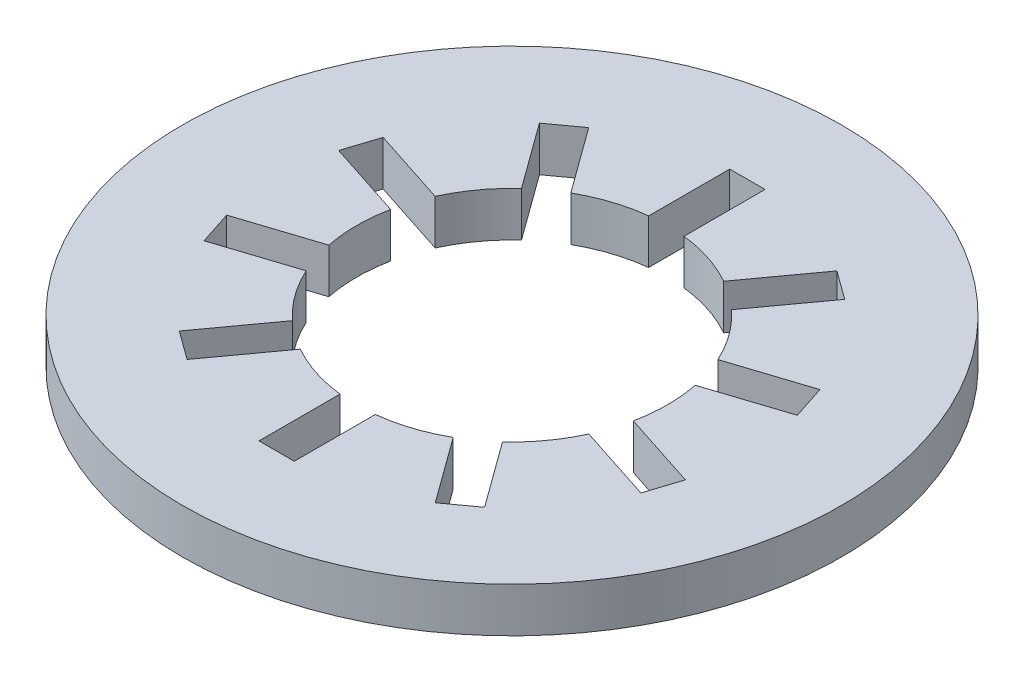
ISO-10303-21;
HEADER;
FILE_DESCRIPTION(('STEP AP214'),'2;1');
FILE_NAME('part.step','',(''),(''),'','','');
FILE_SCHEMA(('AUTOMOTIVE_DESIGN { 1 0 10303 214 1 1 1 1 }'));
ENDSEC;
DATA;
#1=APPLICATION_CONTEXT('core data for automotive mechanical design processes');
#2=APPLICATION_PROTOCOL_DEFINITION('international standard','automotive_design',2000,#1);
#3=PRODUCT_CONTEXT('',#1,'mechanical');
#4=PRODUCT('Part','Part','',(#3));
#5=PRODUCT_RELATED_PRODUCT_CATEGORY('part','',(#4));
#6=PRODUCT_DEFINITION_FORMATION('','',#4);
#7=PRODUCT_DEFINITION_CONTEXT('part definition',#1,'design');
#8=PRODUCT_DEFINITION('design','',#6,#7);
#9=PRODUCT_DEFINITION_SHAPE('','',#8);
#10=(LENGTH_UNIT() NAMED_UNIT(*) SI_UNIT(.MILLI.,.METRE.));
#11=(NAMED_UNIT(*) PLANE_ANGLE_UNIT() SI_UNIT($,.RADIAN.));
#12=(NAMED_UNIT(*) SI_UNIT($,.STERADIAN.) SOLID_ANGLE_UNIT());
#13=UNCERTAINTY_MEASURE_WITH_UNIT(LENGTH_MEASURE(1.E-05),#10,'distance_accuracy_value','');
#14=(GEOMETRIC_REPRESENTATION_CONTEXT(3) GLOBAL_UNCERTAINTY_ASSIGNED_CONTEXT((#13)) GLOBAL_UNIT_ASSIGNED_CONTEXT((#10,
#11,#12)) REPRESENTATION_CONTEXT('',''));
#15=CARTESIAN_POINT('',(0.,0.,0.));
#16=DIRECTION('',(0.,0.,1.));
#17=DIRECTION('',(1.,0.,0.));
#18=AXIS2_PLACEMENT_3D('',#15,#16,#17);
#19=CARTESIAN_POINT('',(0.,0.4826,0.));
#20=DIRECTION('',(0.,1.,0.));
#21=DIRECTION('',(0.,0.,1.));
#22=AXIS2_PLACEMENT_3D('',#19,#20,#21);
#23=PLANE('',#22);
#24=CARTESIAN_POINT('',(0.,0.4826,0.));
#25=DIRECTION('',(0.,1.,0.));
#26=DIRECTION('',(0.,0.,1.));
#27=AXIS2_PLACEMENT_3D('',#24,#25,#26);
#28=CIRCLE('',#27,3.556);
#29=CARTESIAN_POINT('',(0.,0.4826,-3.556));
#30=VERTEX_POINT('',#29);
#31=EDGE_CURVE('E11',#30,#30,#28,.T.);
#32=ORIENTED_EDGE('',*,*,#31,.T.);
#33=EDGE_LOOP('',(#32));
#34=FACE_BOUND('',#33,.T.);
#35=DIRECTION('',(-1.,0.,0.));
#36=VECTOR('',#35,1.);
#37=CARTESIAN_POINT('',(0.1905,0.4826,-2.54));
#38=LINE('',#37,#36);
#39=CARTESIAN_POINT('',(0.1905,0.4826,-2.54));
#40=VERTEX_POINT('',#39);
#41=CARTESIAN_POINT('',(-0.1905,0.4826,-2.54));
#42=VERTEX_POINT('',#41);
#43=EDGE_CURVE('E300',#40,#42,#38,.T.);
#44=ORIENTED_EDGE('',*,*,#43,.F.);
#45=DIRECTION('',(0.,0.,-1.));
#46=VECTOR('',#45,1.);
#47=CARTESIAN_POINT('',(0.1905,0.4826,-2.54));
#48=LINE('',#47,#46);
#49=CARTESIAN_POINT('',(0.1905,0.4826,-1.66554096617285));
#50=VERTEX_POINT('',#49);
#51=EDGE_CURVE('E292',#50,#40,#48,.T.);
#52=ORIENTED_EDGE('',*,*,#51,.F.);
#53=CARTESIAN_POINT('',(0.,0.4826,0.));
#54=DIRECTION('',(0.,1.,0.));
#55=DIRECTION('',(0.,0.,1.));
#56=AXIS2_PLACEMENT_3D('',#53,#54,#55);
#57=CIRCLE('',#56,1.6764);
#58=CARTESIAN_POINT('',(0.824862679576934,0.4826,-1.45942403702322));
#59=VERTEX_POINT('',#58);
#60=EDGE_CURVE('E388',#59,#50,#57,.T.);
#61=ORIENTED_EDGE('',*,*,#60,.F.);
#62=DIRECTION('',(-0.587785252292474,0.,0.809016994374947));
#63=VECTOR('',#62,1.);
#64=CARTESIAN_POINT('',(1.33885680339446,0.4826,-2.16687625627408));
#65=LINE('',#64,#63);
#66=CARTESIAN_POINT('',(1.33885680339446,0.4826,-2.16687625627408));
#67=VERTEX_POINT('',#66);
#68=EDGE_CURVE('E386',#67,#59,#65,.T.);
#69=ORIENTED_EDGE('',*,*,#68,.F.);
#70=DIRECTION('',(-0.809016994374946,0.,-0.587785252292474));
#71=VECTOR('',#70,1.);
#72=CARTESIAN_POINT('',(1.64709227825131,0.4826,-1.94293007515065));
#73=LINE('',#72,#71);
#74=CARTESIAN_POINT('',(1.64709227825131,0.4826,-1.94293007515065));
#75=VERTEX_POINT('',#74);
#76=EDGE_CURVE('E384',#75,#67,#73,.T.);
#77=ORIENTED_EDGE('',*,*,#76,.F.);
#78=DIRECTION('',(0.587785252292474,0.,-0.809016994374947));
#79=VECTOR('',#78,1.);
#80=CARTESIAN_POINT('',(1.64709227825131,0.4826,-1.94293007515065));
#81=LINE('',#80,#79);
#82=CARTESIAN_POINT('',(1.13309815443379,0.4826,-1.23547785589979));
#83=VERTEX_POINT('',#82);
#84=EDGE_CURVE('E382',#83,#75,#81,.T.);
#85=ORIENTED_EDGE('',*,*,#84,.F.);
#86=CARTESIAN_POINT('',(0.,0.4826,0.));
#87=DIRECTION('',(0.,1.,0.));
#88=DIRECTION('',(0.,0.,1.));
#89=AXIS2_PLACEMENT_3D('',#86,#87,#88);
#90=CIRCLE('',#89,1.6764);
#91=CARTESIAN_POINT('',(1.52515585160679,0.4826,-0.695856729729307));
#92=VERTEX_POINT('',#91);
#93=EDGE_CURVE('E380',#92,#83,#90,.T.);
#94=ORIENTED_EDGE('',*,*,#93,.F.);
#95=DIRECTION('',(-0.951056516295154,0.,0.309016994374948));
#96=VECTOR('',#95,1.);
#97=CARTESIAN_POINT('',(2.35681581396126,0.4826,-0.966079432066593));
#98=LINE('',#97,#96);
#99=CARTESIAN_POINT('',(2.35681581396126,0.4826,-0.966079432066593));
#100=VERTEX_POINT('',#99);
#101=EDGE_CURVE('E378',#100,#92,#98,.T.);
#102=ORIENTED_EDGE('',*,*,#101,.F.);
#103=DIRECTION('',(-0.309016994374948,0.,-0.951056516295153));
#104=VECTOR('',#103,1.);
#105=CARTESIAN_POINT('',(2.47455128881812,0.4826,-0.603726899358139));
#106=LINE('',#105,#104);
#107=CARTESIAN_POINT('',(2.47455128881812,0.4826,-0.603726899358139));
#108=VERTEX_POINT('',#107);
#109=EDGE_CURVE('E376',#108,#100,#106,.T.);
#110=ORIENTED_EDGE('',*,*,#109,.F.);
#111=DIRECTION('',(0.951056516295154,0.,-0.309016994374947));
#112=VECTOR('',#111,1.);
#113=CARTESIAN_POINT('',(2.47455128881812,0.4826,-0.603726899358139));
#114=LINE('',#113,#112);
#115=CARTESIAN_POINT('',(1.64289132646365,0.4826,-0.333504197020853));
#116=VERTEX_POINT('',#115);
#117=EDGE_CURVE('E374',#116,#108,#114,.T.);
#118=ORIENTED_EDGE('',*,*,#117,.F.);
#119=CARTESIAN_POINT('',(0.,0.4826,0.));
#120=DIRECTION('',(0.,1.,0.));
#121=DIRECTION('',(0.,0.,1.));
#122=AXIS2_PLACEMENT_3D('',#119,#120,#121);
#123=CIRCLE('',#122,1.6764);
#124=CARTESIAN_POINT('',(1.64289132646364,0.4826,0.333504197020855));
#125=VERTEX_POINT('',#124);
#126=EDGE_CURVE('E372',#125,#116,#123,.T.);
#127=ORIENTED_EDGE('',*,*,#126,.F.);
#128=DIRECTION('',(-0.951056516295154,0.,-0.309016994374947));
#129=VECTOR('',#128,1.);
#130=CARTESIAN_POINT('',(2.47455128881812,0.4826,0.603726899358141));
#131=LINE('',#130,#129);
#132=CARTESIAN_POINT('',(2.47455128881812,0.4826,0.603726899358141));
#133=VERTEX_POINT('',#132);
#134=EDGE_CURVE('E370',#133,#125,#131,.T.);
#135=ORIENTED_EDGE('',*,*,#134,.F.);
#136=DIRECTION('',(0.309016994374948,0.,-0.951056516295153));
#137=VECTOR('',#136,1.);
#138=CARTESIAN_POINT('',(2.35681581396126,0.4826,0.966079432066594));
#139=LINE('',#138,#137);
#140=CARTESIAN_POINT('',(2.35681581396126,0.4826,0.966079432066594));
#141=VERTEX_POINT('',#140);
#142=EDGE_CURVE('E368',#141,#133,#139,.T.);
#143=ORIENTED_EDGE('',*,*,#142,.F.);
#144=DIRECTION('',(0.951056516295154,0.,0.309016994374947));
#145=VECTOR('',#144,1.);
#146=CARTESIAN_POINT('',(2.35681581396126,0.4826,0.966079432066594));
#147=LINE('',#146,#145);
#148=CARTESIAN_POINT('',(1.52515585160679,0.4826,0.695856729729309));
#149=VERTEX_POINT('',#148);
#150=EDGE_CURVE('E366',#149,#141,#147,.T.);
#151=ORIENTED_EDGE('',*,*,#150,.F.);
#152=CARTESIAN_POINT('',(0.,0.4826,0.));
#153=DIRECTION('',(0.,1.,0.));
#154=DIRECTION('',(0.,0.,1.));
#155=AXIS2_PLACEMENT_3D('',#152,#153,#154);
#156=CIRCLE('',#155,1.6764);
#157=CARTESIAN_POINT('',(1.13309815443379,0.4826,1.23547785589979));
#158=VERTEX_POINT('',#157);
#159=EDGE_CURVE('E364',#158,#149,#156,.T.);
#160=ORIENTED_EDGE('',*,*,#159,.F.);
#161=DIRECTION('',(-0.587785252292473,0.,-0.809016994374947));
#162=VECTOR('',#161,1.);
#163=CARTESIAN_POINT('',(1.64709227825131,0.4826,1.94293007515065));
#164=LINE('',#163,#162);
#165=CARTESIAN_POINT('',(1.64709227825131,0.4826,1.94293007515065));
#166=VERTEX_POINT('',#165);
#167=EDGE_CURVE('E362',#166,#158,#164,.T.);
#168=ORIENTED_EDGE('',*,*,#167,.F.);
#169=DIRECTION('',(0.809016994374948,0.,-0.587785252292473));
#170=VECTOR('',#169,1.);
#171=CARTESIAN_POINT('',(1.33885680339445,0.4826,2.16687625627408));
#172=LINE('',#171,#170);
#173=CARTESIAN_POINT('',(1.33885680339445,0.4826,2.16687625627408));
#174=VERTEX_POINT('',#173);
#175=EDGE_CURVE('E360',#174,#166,#172,.T.);
#176=ORIENTED_EDGE('',*,*,#175,.F.);
#177=DIRECTION('',(0.587785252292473,0.,0.809016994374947));
#178=VECTOR('',#177,1.);
#179=CARTESIAN_POINT('',(1.33885680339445,0.4826,2.16687625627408));
#180=LINE('',#179,#178);
#181=CARTESIAN_POINT('',(0.824862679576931,0.4826,1.45942403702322));
#182=VERTEX_POINT('',#181);
#183=EDGE_CURVE('E358',#182,#174,#180,.T.);
#184=ORIENTED_EDGE('',*,*,#183,.F.);
#185=CARTESIAN_POINT('',(0.,0.4826,0.));
#186=DIRECTION('',(0.,1.,0.));
#187=DIRECTION('',(0.,0.,1.));
#188=AXIS2_PLACEMENT_3D('',#185,#186,#187);
#189=CIRCLE('',#188,1.6764);
#190=CARTESIAN_POINT('',(0.190499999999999,0.4826,1.66554096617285));
#191=VERTEX_POINT('',#190);
#192=EDGE_CURVE('E356',#191,#182,#189,.T.);
#193=ORIENTED_EDGE('',*,*,#192,.F.);
#194=DIRECTION('',(0.,0.,-1.));
#195=VECTOR('',#194,1.);
#196=CARTESIAN_POINT('',(0.190499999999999,0.4826,2.54));
#197=LINE('',#196,#195);
#198=CARTESIAN_POINT('',(0.190499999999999,0.4826,2.54));
#199=VERTEX_POINT('',#198);
#200=EDGE_CURVE('E354',#199,#191,#197,.T.);
#201=ORIENTED_EDGE('',*,*,#200,.F.);
#202=DIRECTION('',(1.,0.,0.));
#203=VECTOR('',#202,1.);
#204=CARTESIAN_POINT('',(-0.190500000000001,0.4826,2.54));
#205=LINE('',#204,#203);
#206=CARTESIAN_POINT('',(-0.190500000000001,0.4826,2.54));
#207=VERTEX_POINT('',#206);
#208=EDGE_CURVE('E352',#207,#199,#205,.T.);
#209=ORIENTED_EDGE('',*,*,#208,.F.);
#210=DIRECTION('',(0.,0.,1.));
#211=VECTOR('',#210,1.);
#212=CARTESIAN_POINT('',(-0.190500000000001,0.4826,2.54));
#213=LINE('',#212,#211);
#214=CARTESIAN_POINT('',(-0.190500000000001,0.4826,1.66554096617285));
#215=VERTEX_POINT('',#214);
#216=EDGE_CURVE('E350',#215,#207,#213,.T.);
#217=ORIENTED_EDGE('',*,*,#216,.F.);
#218=CARTESIAN_POINT('',(0.,0.4826,0.));
#219=DIRECTION('',(0.,1.,0.));
#220=DIRECTION('',(0.,0.,1.));
#221=AXIS2_PLACEMENT_3D('',#218,#219,#220);
#222=CIRCLE('',#221,1.6764);
#223=CARTESIAN_POINT('',(-0.824862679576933,0.4826,1.45942403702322));
#224=VERTEX_POINT('',#223);
#225=EDGE_CURVE('E348',#224,#215,#222,.T.);
#226=ORIENTED_EDGE('',*,*,#225,.F.);
#227=DIRECTION('',(0.587785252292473,0.,-0.809016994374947));
#228=VECTOR('',#227,1.);
#229=CARTESIAN_POINT('',(-1.33885680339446,0.4826,2.16687625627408));
#230=LINE('',#229,#228);
#231=CARTESIAN_POINT('',(-1.33885680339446,0.4826,2.16687625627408));
#232=VERTEX_POINT('',#231);
#233=EDGE_CURVE('E346',#232,#224,#230,.T.);
#234=ORIENTED_EDGE('',*,*,#233,.F.);
#235=DIRECTION('',(0.809016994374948,0.,0.587785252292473));
#236=VECTOR('',#235,1.);
#237=CARTESIAN_POINT('',(-1.64709227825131,0.4826,1.94293007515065));
#238=LINE('',#237,#236);
#239=CARTESIAN_POINT('',(-1.64709227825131,0.4826,1.94293007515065));
#240=VERTEX_POINT('',#239);
#241=EDGE_CURVE('E344',#240,#232,#238,.T.);
#242=ORIENTED_EDGE('',*,*,#241,.F.);
#243=DIRECTION('',(-0.587785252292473,0.,0.809016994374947));
#244=VECTOR('',#243,1.);
#245=CARTESIAN_POINT('',(-1.64709227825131,0.4826,1.94293007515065));
#246=LINE('',#245,#244);
#247=CARTESIAN_POINT('',(-1.13309815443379,0.4826,1.23547785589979));
#248=VERTEX_POINT('',#247);
#249=EDGE_CURVE('E342',#248,#240,#246,.T.);
#250=ORIENTED_EDGE('',*,*,#249,.F.);
#251=CARTESIAN_POINT('',(0.,0.4826,0.));
#252=DIRECTION('',(0.,1.,0.));
#253=DIRECTION('',(0.,0.,1.));
#254=AXIS2_PLACEMENT_3D('',#251,#252,#253);
#255=CIRCLE('',#254,1.6764);
#256=CARTESIAN_POINT('',(-1.52515585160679,0.4826,0.695856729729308));
#257=VERTEX_POINT('',#256);
#258=EDGE_CURVE('E340',#257,#248,#255,.T.);
#259=ORIENTED_EDGE('',*,*,#258,.F.);
#260=DIRECTION('',(0.951056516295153,0.,-0.309016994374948));
#261=VECTOR('',#260,1.);
#262=CARTESIAN_POINT('',(-2.35681581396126,0.4826,0.966079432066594));
#263=LINE('',#262,#261);
#264=CARTESIAN_POINT('',(-2.35681581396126,0.4826,0.966079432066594));
#265=VERTEX_POINT('',#264);
#266=EDGE_CURVE('E338',#265,#257,#263,.T.);
#267=ORIENTED_EDGE('',*,*,#266,.F.);
#268=DIRECTION('',(0.309016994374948,0.,0.951056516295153));
#269=VECTOR('',#268,1.);
#270=CARTESIAN_POINT('',(-2.47455128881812,0.4826,0.60372689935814));
#271=LINE('',#270,#269);
#272=CARTESIAN_POINT('',(-2.47455128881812,0.4826,0.60372689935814));
#273=VERTEX_POINT('',#272);
#274=EDGE_CURVE('E336',#273,#265,#271,.T.);
#275=ORIENTED_EDGE('',*,*,#274,.F.);
#276=DIRECTION('',(-0.951056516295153,0.,0.309016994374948));
#277=VECTOR('',#276,1.);
#278=CARTESIAN_POINT('',(-2.47455128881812,0.4826,0.60372689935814));
#279=LINE('',#278,#277);
#280=CARTESIAN_POINT('',(-1.64289132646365,0.4826,0.333504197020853));
#281=VERTEX_POINT('',#280);
#282=EDGE_CURVE('E334',#281,#273,#279,.T.);
#283=ORIENTED_EDGE('',*,*,#282,.F.);
#284=CARTESIAN_POINT('',(0.,0.4826,0.));
#285=DIRECTION('',(0.,1.,0.));
#286=DIRECTION('',(0.,0.,1.));
#287=AXIS2_PLACEMENT_3D('',#284,#285,#286);
#288=CIRCLE('',#287,1.6764);
#289=CARTESIAN_POINT('',(-1.64289132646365,0.4826,-0.333504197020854));
#290=VERTEX_POINT('',#289);
#291=EDGE_CURVE('E332',#290,#281,#288,.T.);
#292=ORIENTED_EDGE('',*,*,#291,.F.);
#293=DIRECTION('',(0.951056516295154,0.,0.309016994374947));
#294=VECTOR('',#293,1.);
#295=CARTESIAN_POINT('',(-2.47455128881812,0.4826,-0.60372689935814));
#296=LINE('',#295,#294);
#297=CARTESIAN_POINT('',(-2.47455128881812,0.4826,-0.60372689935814));
#298=VERTEX_POINT('',#297);
#299=EDGE_CURVE('E330',#298,#290,#296,.T.);
#300=ORIENTED_EDGE('',*,*,#299,.F.);
#301=DIRECTION('',(-0.309016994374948,0.,0.951056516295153));
#302=VECTOR('',#301,1.);
#303=CARTESIAN_POINT('',(-2.35681581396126,0.4826,-0.966079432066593));
#304=LINE('',#303,#302);
#305=CARTESIAN_POINT('',(-2.35681581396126,0.4826,-0.966079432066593));
#306=VERTEX_POINT('',#305);
#307=EDGE_CURVE('E328',#306,#298,#304,.T.);
#308=ORIENTED_EDGE('',*,*,#307,.F.);
#309=DIRECTION('',(-0.951056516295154,0.,-0.309016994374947));
#310=VECTOR('',#309,1.);
#311=CARTESIAN_POINT('',(-2.35681581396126,0.4826,-0.966079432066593));
#312=LINE('',#311,#310);
#313=CARTESIAN_POINT('',(-1.52515585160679,0.4826,-0.695856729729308));
#314=VERTEX_POINT('',#313);
#315=EDGE_CURVE('E326',#314,#306,#312,.T.);
#316=ORIENTED_EDGE('',*,*,#315,.F.);
#317=CARTESIAN_POINT('',(0.,0.4826,0.));
#318=DIRECTION('',(0.,1.,0.));
#319=DIRECTION('',(0.,0.,1.));
#320=AXIS2_PLACEMENT_3D('',#317,#318,#319);
#321=CIRCLE('',#320,1.6764);
#322=CARTESIAN_POINT('',(-1.13309815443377,0.4826,-1.23547785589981));
#323=VERTEX_POINT('',#322);
#324=EDGE_CURVE('E324',#323,#314,#321,.T.);
#325=ORIENTED_EDGE('',*,*,#324,.F.);
#326=DIRECTION('',(0.587785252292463,0.,0.809016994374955));
#327=VECTOR('',#326,1.);
#328=CARTESIAN_POINT('',(-1.64709227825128,0.4826,-1.94293007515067));
#329=LINE('',#328,#327);
#330=CARTESIAN_POINT('',(-1.64709227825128,0.4826,-1.94293007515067));
#331=VERTEX_POINT('',#330);
#332=EDGE_CURVE('E322',#331,#323,#329,.T.);
#333=ORIENTED_EDGE('',*,*,#332,.F.);
#334=DIRECTION('',(-0.809016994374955,0.,0.587785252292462));
#335=VECTOR('',#334,1.);
#336=CARTESIAN_POINT('',(-1.33885680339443,0.4826,-2.1668762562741));
#337=LINE('',#336,#335);
#338=CARTESIAN_POINT('',(-1.33885680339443,0.4826,-2.1668762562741));
#339=VERTEX_POINT('',#338);
#340=EDGE_CURVE('E320',#339,#331,#337,.T.);
#341=ORIENTED_EDGE('',*,*,#340,.F.);
#342=DIRECTION('',(-0.587785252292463,0.,-0.809016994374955));
#343=VECTOR('',#342,1.);
#344=CARTESIAN_POINT('',(-1.33885680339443,0.4826,-2.1668762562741));
#345=LINE('',#344,#343);
#346=CARTESIAN_POINT('',(-0.824862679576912,0.4826,-1.45942403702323));
#347=VERTEX_POINT('',#346);
#348=EDGE_CURVE('E318',#347,#339,#345,.T.);
#349=ORIENTED_EDGE('',*,*,#348,.F.);
#350=CARTESIAN_POINT('',(0.,0.4826,0.));
#351=DIRECTION('',(0.,1.,0.));
#352=DIRECTION('',(0.,0.,1.));
#353=AXIS2_PLACEMENT_3D('',#350,#351,#352);
#354=CIRCLE('',#353,1.6764);
#355=CARTESIAN_POINT('',(-0.1905,0.4826,-1.66554096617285));
#356=VERTEX_POINT('',#355);
#357=EDGE_CURVE('E314',#356,#347,#354,.T.);
#358=ORIENTED_EDGE('',*,*,#357,.F.);
#359=DIRECTION('',(0.,0.,1.));
#360=VECTOR('',#359,1.);
#361=CARTESIAN_POINT('',(-0.1905,0.4826,-2.54));
#362=LINE('',#361,#360);
#363=EDGE_CURVE('E312',#42,#356,#362,.T.);
#364=ORIENTED_EDGE('',*,*,#363,.F.);
#365=EDGE_LOOP('',(#44,#52,#61,#69,#77,#85,#94,#102,#110,#118,#127,#135,#143,#151,#160,#168,
#176,#184,#193,#201,#209,#217,#226,#234,#242,#250,#259,#267,#275,#283,#292,#300,#308,#316,#325,
#333,#341,#349,#358,#364));
#366=FACE_BOUND('',#365,.T.);
#367=ADVANCED_FACE('F35',(#34,#366),#23,.T.);
#368=CARTESIAN_POINT('',(0.,0.,0.));
#369=DIRECTION('',(0.,1.,0.));
#370=DIRECTION('',(0.,0.,1.));
#371=AXIS2_PLACEMENT_3D('',#368,#369,#370);
#372=PLANE('',#371);
#373=CARTESIAN_POINT('',(0.,0.,0.));
#374=DIRECTION('',(0.,1.,0.));
#375=DIRECTION('',(0.,0.,1.));
#376=AXIS2_PLACEMENT_3D('',#373,#374,#375);
#377=CIRCLE('',#376,3.556);
#378=CARTESIAN_POINT('',(0.,0.,-3.556));
#379=VERTEX_POINT('',#378);
#380=EDGE_CURVE('E39',#379,#379,#377,.T.);
#381=ORIENTED_EDGE('',*,*,#380,.F.);
#382=EDGE_LOOP('',(#381));
#383=FACE_BOUND('',#382,.T.);
#384=DIRECTION('',(0.,0.,-1.));
#385=VECTOR('',#384,1.);
#386=CARTESIAN_POINT('',(0.1905,0.,-2.54));
#387=LINE('',#386,#385);
#388=CARTESIAN_POINT('',(0.1905,0.,-1.66554096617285));
#389=VERTEX_POINT('',#388);
#390=CARTESIAN_POINT('',(0.1905,0.,-2.54));
#391=VERTEX_POINT('',#390);
#392=EDGE_CURVE('E58',#389,#391,#387,.T.);
#393=ORIENTED_EDGE('',*,*,#392,.T.);
#394=DIRECTION('',(-1.,0.,0.));
#395=VECTOR('',#394,1.);
#396=CARTESIAN_POINT('',(0.1905,0.,-2.54));
#397=LINE('',#396,#395);
#398=CARTESIAN_POINT('',(-0.1905,0.,-2.54));
#399=VERTEX_POINT('',#398);
#400=EDGE_CURVE('E307',#391,#399,#397,.T.);
#401=ORIENTED_EDGE('',*,*,#400,.T.);
#402=DIRECTION('',(0.,0.,1.));
#403=VECTOR('',#402,1.);
#404=CARTESIAN_POINT('',(-0.1905,0.,-2.54));
#405=LINE('',#404,#403);
#406=CARTESIAN_POINT('',(-0.1905,0.,-1.66554096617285));
#407=VERTEX_POINT('',#406);
#408=EDGE_CURVE('E392',#399,#407,#405,.T.);
#409=ORIENTED_EDGE('',*,*,#408,.T.);
#410=CARTESIAN_POINT('',(0.,0.,0.));
#411=DIRECTION('',(0.,1.,0.));
#412=DIRECTION('',(0.,0.,1.));
#413=AXIS2_PLACEMENT_3D('',#410,#411,#412);
#414=CIRCLE('',#413,1.6764);
#415=CARTESIAN_POINT('',(-0.824862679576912,0.,-1.45942403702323));
#416=VERTEX_POINT('',#415);
#417=EDGE_CURVE('E395',#407,#416,#414,.T.);
#418=ORIENTED_EDGE('',*,*,#417,.T.);
#419=DIRECTION('',(-0.587785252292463,0.,-0.809016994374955));
#420=VECTOR('',#419,1.);
#421=CARTESIAN_POINT('',(-1.33885680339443,0.,-2.1668762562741));
#422=LINE('',#421,#420);
#423=CARTESIAN_POINT('',(-1.33885680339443,0.,-2.1668762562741));
#424=VERTEX_POINT('',#423);
#425=EDGE_CURVE('E398',#416,#424,#422,.T.);
#426=ORIENTED_EDGE('',*,*,#425,.T.);
#427=DIRECTION('',(-0.809016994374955,0.,0.587785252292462));
#428=VECTOR('',#427,1.);
#429=CARTESIAN_POINT('',(-1.33885680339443,0.,-2.1668762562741));
#430=LINE('',#429,#428);
#431=CARTESIAN_POINT('',(-1.64709227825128,0.,-1.94293007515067));
#432=VERTEX_POINT('',#431);
#433=EDGE_CURVE('E401',#424,#432,#430,.T.);
#434=ORIENTED_EDGE('',*,*,#433,.T.);
#435=DIRECTION('',(0.587785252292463,0.,0.809016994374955));
#436=VECTOR('',#435,1.);
#437=CARTESIAN_POINT('',(-1.64709227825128,0.,-1.94293007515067));
#438=LINE('',#437,#436);
#439=CARTESIAN_POINT('',(-1.13309815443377,0.,-1.23547785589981));
#440=VERTEX_POINT('',#439);
#441=EDGE_CURVE('E404',#432,#440,#438,.T.);
#442=ORIENTED_EDGE('',*,*,#441,.T.);
#443=CARTESIAN_POINT('',(0.,0.,0.));
#444=DIRECTION('',(0.,1.,0.));
#445=DIRECTION('',(0.,0.,1.));
#446=AXIS2_PLACEMENT_3D('',#443,#444,#445);
#447=CIRCLE('',#446,1.6764);
#448=CARTESIAN_POINT('',(-1.52515585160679,0.,-0.695856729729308));
#449=VERTEX_POINT('',#448);
#450=EDGE_CURVE('E407',#440,#449,#447,.T.);
#451=ORIENTED_EDGE('',*,*,#450,.T.);
#452=DIRECTION('',(-0.951056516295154,0.,-0.309016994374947));
#453=VECTOR('',#452,1.);
#454=CARTESIAN_POINT('',(-2.35681581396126,0.,-0.966079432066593));
#455=LINE('',#454,#453);
#456=CARTESIAN_POINT('',(-2.35681581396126,0.,-0.966079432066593));
#457=VERTEX_POINT('',#456);
#458=EDGE_CURVE('E410',#449,#457,#455,.T.);
#459=ORIENTED_EDGE('',*,*,#458,.T.);
#460=DIRECTION('',(-0.309016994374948,0.,0.951056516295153));
#461=VECTOR('',#460,1.);
#462=CARTESIAN_POINT('',(-2.35681581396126,0.,-0.966079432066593));
#463=LINE('',#462,#461);
#464=CARTESIAN_POINT('',(-2.47455128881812,0.,-0.60372689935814));
#465=VERTEX_POINT('',#464);
#466=EDGE_CURVE('E413',#457,#465,#463,.T.);
#467=ORIENTED_EDGE('',*,*,#466,.T.);
#468=DIRECTION('',(0.951056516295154,0.,0.309016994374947));
#469=VECTOR('',#468,1.);
#470=CARTESIAN_POINT('',(-2.47455128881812,0.,-0.60372689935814));
#471=LINE('',#470,#469);
#472=CARTESIAN_POINT('',(-1.64289132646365,0.,-0.333504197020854));
#473=VERTEX_POINT('',#472);
#474=EDGE_CURVE('E416',#465,#473,#471,.T.);
#475=ORIENTED_EDGE('',*,*,#474,.T.);
#476=CARTESIAN_POINT('',(0.,0.,0.));
#477=DIRECTION('',(0.,1.,0.));
#478=DIRECTION('',(0.,0.,1.));
#479=AXIS2_PLACEMENT_3D('',#476,#477,#478);
#480=CIRCLE('',#479,1.6764);
#481=CARTESIAN_POINT('',(-1.64289132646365,0.,0.333504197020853));
#482=VERTEX_POINT('',#481);
#483=EDGE_CURVE('E419',#473,#482,#480,.T.);
#484=ORIENTED_EDGE('',*,*,#483,.T.);
#485=DIRECTION('',(-0.951056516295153,0.,0.309016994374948));
#486=VECTOR('',#485,1.);
#487=CARTESIAN_POINT('',(-2.47455128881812,0.,0.60372689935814));
#488=LINE('',#487,#486);
#489=CARTESIAN_POINT('',(-2.47455128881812,0.,0.60372689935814));
#490=VERTEX_POINT('',#489);
#491=EDGE_CURVE('E422',#482,#490,#488,.T.);
#492=ORIENTED_EDGE('',*,*,#491,.T.);
#493=DIRECTION('',(0.309016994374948,0.,0.951056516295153));
#494=VECTOR('',#493,1.);
#495=CARTESIAN_POINT('',(-2.47455128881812,0.,0.60372689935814));
#496=LINE('',#495,#494);
#497=CARTESIAN_POINT('',(-2.35681581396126,0.,0.966079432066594));
#498=VERTEX_POINT('',#497);
#499=EDGE_CURVE('E425',#490,#498,#496,.T.);
#500=ORIENTED_EDGE('',*,*,#499,.T.);
#501=DIRECTION('',(0.951056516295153,0.,-0.309016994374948));
#502=VECTOR('',#501,1.);
#503=CARTESIAN_POINT('',(-2.35681581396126,0.,0.966079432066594));
#504=LINE('',#503,#502);
#505=CARTESIAN_POINT('',(-1.52515585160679,0.,0.695856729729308));
#506=VERTEX_POINT('',#505);
#507=EDGE_CURVE('E428',#498,#506,#504,.T.);
#508=ORIENTED_EDGE('',*,*,#507,.T.);
#509=CARTESIAN_POINT('',(0.,0.,0.));
#510=DIRECTION('',(0.,1.,0.));
#511=DIRECTION('',(0.,0.,1.));
#512=AXIS2_PLACEMENT_3D('',#509,#510,#511);
#513=CIRCLE('',#512,1.6764);
#514=CARTESIAN_POINT('',(-1.13309815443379,0.,1.23547785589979));
#515=VERTEX_POINT('',#514);
#516=EDGE_CURVE('E431',#506,#515,#513,.T.);
#517=ORIENTED_EDGE('',*,*,#516,.T.);
#518=DIRECTION('',(-0.587785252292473,0.,0.809016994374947));
#519=VECTOR('',#518,1.);
#520=CARTESIAN_POINT('',(-1.64709227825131,0.,1.94293007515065));
#521=LINE('',#520,#519);
#522=CARTESIAN_POINT('',(-1.64709227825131,0.,1.94293007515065));
#523=VERTEX_POINT('',#522);
#524=EDGE_CURVE('E434',#515,#523,#521,.T.);
#525=ORIENTED_EDGE('',*,*,#524,.T.);
#526=DIRECTION('',(0.809016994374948,0.,0.587785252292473));
#527=VECTOR('',#526,1.);
#528=CARTESIAN_POINT('',(-1.64709227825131,0.,1.94293007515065));
#529=LINE('',#528,#527);
#530=CARTESIAN_POINT('',(-1.33885680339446,0.,2.16687625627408));
#531=VERTEX_POINT('',#530);
#532=EDGE_CURVE('E437',#523,#531,#529,.T.);
#533=ORIENTED_EDGE('',*,*,#532,.T.);
#534=DIRECTION('',(0.587785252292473,0.,-0.809016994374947));
#535=VECTOR('',#534,1.);
#536=CARTESIAN_POINT('',(-1.33885680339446,0.,2.16687625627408));
#537=LINE('',#536,#535);
#538=CARTESIAN_POINT('',(-0.824862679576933,0.,1.45942403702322));
#539=VERTEX_POINT('',#538);
#540=EDGE_CURVE('E440',#531,#539,#537,.T.);
#541=ORIENTED_EDGE('',*,*,#540,.T.);
#542=CARTESIAN_POINT('',(0.,0.,0.));
#543=DIRECTION('',(0.,1.,0.));
#544=DIRECTION('',(0.,0.,1.));
#545=AXIS2_PLACEMENT_3D('',#542,#543,#544);
#546=CIRCLE('',#545,1.6764);
#547=CARTESIAN_POINT('',(-0.190500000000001,0.,1.66554096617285));
#548=VERTEX_POINT('',#547);
#549=EDGE_CURVE('E443',#539,#548,#546,.T.);
#550=ORIENTED_EDGE('',*,*,#549,.T.);
#551=DIRECTION('',(0.,0.,1.));
#552=VECTOR('',#551,1.);
#553=CARTESIAN_POINT('',(-0.190500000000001,0.,2.54));
#554=LINE('',#553,#552);
#555=CARTESIAN_POINT('',(-0.190500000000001,0.,2.54));
#556=VERTEX_POINT('',#555);
#557=EDGE_CURVE('E446',#548,#556,#554,.T.);
#558=ORIENTED_EDGE('',*,*,#557,.T.);
#559=DIRECTION('',(1.,0.,0.));
#560=VECTOR('',#559,1.);
#561=CARTESIAN_POINT('',(-0.190500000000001,0.,2.54));
#562=LINE('',#561,#560);
#563=CARTESIAN_POINT('',(0.190499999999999,0.,2.54));
#564=VERTEX_POINT('',#563);
#565=EDGE_CURVE('E449',#556,#564,#562,.T.);
#566=ORIENTED_EDGE('',*,*,#565,.T.);
#567=DIRECTION('',(0.,0.,-1.));
#568=VECTOR('',#567,1.);
#569=CARTESIAN_POINT('',(0.190499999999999,0.,2.54));
#570=LINE('',#569,#568);
#571=CARTESIAN_POINT('',(0.190499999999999,0.,1.66554096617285));
#572=VERTEX_POINT('',#571);
#573=EDGE_CURVE('E452',#564,#572,#570,.T.);
#574=ORIENTED_EDGE('',*,*,#573,.T.);
#575=CARTESIAN_POINT('',(0.,0.,0.));
#576=DIRECTION('',(0.,1.,0.));
#577=DIRECTION('',(0.,0.,1.));
#578=AXIS2_PLACEMENT_3D('',#575,#576,#577);
#579=CIRCLE('',#578,1.6764);
#580=CARTESIAN_POINT('',(0.824862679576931,0.,1.45942403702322));
#581=VERTEX_POINT('',#580);
#582=EDGE_CURVE('E455',#572,#581,#579,.T.);
#583=ORIENTED_EDGE('',*,*,#582,.T.);
#584=DIRECTION('',(0.587785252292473,0.,0.809016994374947));
#585=VECTOR('',#584,1.);
#586=CARTESIAN_POINT('',(1.33885680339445,0.,2.16687625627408));
#587=LINE('',#586,#585);
#588=CARTESIAN_POINT('',(1.33885680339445,0.,2.16687625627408));
#589=VERTEX_POINT('',#588);
#590=EDGE_CURVE('E458',#581,#589,#587,.T.);
#591=ORIENTED_EDGE('',*,*,#590,.T.);
#592=DIRECTION('',(0.809016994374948,0.,-0.587785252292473));
#593=VECTOR('',#592,1.);
#594=CARTESIAN_POINT('',(1.33885680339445,0.,2.16687625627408));
#595=LINE('',#594,#593);
#596=CARTESIAN_POINT('',(1.64709227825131,0.,1.94293007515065));
#597=VERTEX_POINT('',#596);
#598=EDGE_CURVE('E461',#589,#597,#595,.T.);
#599=ORIENTED_EDGE('',*,*,#598,.T.);
#600=DIRECTION('',(-0.587785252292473,0.,-0.809016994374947));
#601=VECTOR('',#600,1.);
#602=CARTESIAN_POINT('',(1.64709227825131,0.,1.94293007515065));
#603=LINE('',#602,#601);
#604=CARTESIAN_POINT('',(1.13309815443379,0.,1.23547785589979));
#605=VERTEX_POINT('',#604);
#606=EDGE_CURVE('E464',#597,#605,#603,.T.);
#607=ORIENTED_EDGE('',*,*,#606,.T.);
#608=CARTESIAN_POINT('',(0.,0.,0.));
#609=DIRECTION('',(0.,1.,0.));
#610=DIRECTION('',(0.,0.,1.));
#611=AXIS2_PLACEMENT_3D('',#608,#609,#610);
#612=CIRCLE('',#611,1.6764);
#613=CARTESIAN_POINT('',(1.52515585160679,0.,0.695856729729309));
#614=VERTEX_POINT('',#613);
#615=EDGE_CURVE('E467',#605,#614,#612,.T.);
#616=ORIENTED_EDGE('',*,*,#615,.T.);
#617=DIRECTION('',(0.951056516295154,0.,0.309016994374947));
#618=VECTOR('',#617,1.);
#619=CARTESIAN_POINT('',(2.35681581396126,0.,0.966079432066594));
#620=LINE('',#619,#618);
#621=CARTESIAN_POINT('',(2.35681581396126,0.,0.966079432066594));
#622=VERTEX_POINT('',#621);
#623=EDGE_CURVE('E470',#614,#622,#620,.T.);
#624=ORIENTED_EDGE('',*,*,#623,.T.);
#625=DIRECTION('',(0.309016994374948,0.,-0.951056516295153));
#626=VECTOR('',#625,1.);
#627=CARTESIAN_POINT('',(2.35681581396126,0.,0.966079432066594));
#628=LINE('',#627,#626);
#629=CARTESIAN_POINT('',(2.47455128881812,0.,0.603726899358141));
#630=VERTEX_POINT('',#629);
#631=EDGE_CURVE('E473',#622,#630,#628,.T.);
#632=ORIENTED_EDGE('',*,*,#631,.T.);
#633=DIRECTION('',(-0.951056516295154,0.,-0.309016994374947));
#634=VECTOR('',#633,1.);
#635=CARTESIAN_POINT('',(2.47455128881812,0.,0.603726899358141));
#636=LINE('',#635,#634);
#637=CARTESIAN_POINT('',(1.64289132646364,0.,0.333504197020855));
#638=VERTEX_POINT('',#637);
#639=EDGE_CURVE('E476',#630,#638,#636,.T.);
#640=ORIENTED_EDGE('',*,*,#639,.T.);
#641=CARTESIAN_POINT('',(0.,0.,0.));
#642=DIRECTION('',(0.,1.,0.));
#643=DIRECTION('',(0.,0.,1.));
#644=AXIS2_PLACEMENT_3D('',#641,#642,#643);
#645=CIRCLE('',#644,1.6764);
#646=CARTESIAN_POINT('',(1.64289132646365,0.,-0.333504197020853));
#647=VERTEX_POINT('',#646);
#648=EDGE_CURVE('E479',#638,#647,#645,.T.);
#649=ORIENTED_EDGE('',*,*,#648,.T.);
#650=DIRECTION('',(0.951056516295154,0.,-0.309016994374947));
#651=VECTOR('',#650,1.);
#652=CARTESIAN_POINT('',(2.47455128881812,0.,-0.603726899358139));
#653=LINE('',#652,#651);
#654=CARTESIAN_POINT('',(2.47455128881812,0.,-0.603726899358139));
#655=VERTEX_POINT('',#654);
#656=EDGE_CURVE('E482',#647,#655,#653,.T.);
#657=ORIENTED_EDGE('',*,*,#656,.T.);
#658=DIRECTION('',(-0.309016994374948,0.,-0.951056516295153));
#659=VECTOR('',#658,1.);
#660=CARTESIAN_POINT('',(2.47455128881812,0.,-0.603726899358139));
#661=LINE('',#660,#659);
#662=CARTESIAN_POINT('',(2.35681581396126,0.,-0.966079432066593));
#663=VERTEX_POINT('',#662);
#664=EDGE_CURVE('E485',#655,#663,#661,.T.);
#665=ORIENTED_EDGE('',*,*,#664,.T.);
#666=DIRECTION('',(-0.951056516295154,0.,0.309016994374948));
#667=VECTOR('',#666,1.);
#668=CARTESIAN_POINT('',(2.35681581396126,0.,-0.966079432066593));
#669=LINE('',#668,#667);
#670=CARTESIAN_POINT('',(1.52515585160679,0.,-0.695856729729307));
#671=VERTEX_POINT('',#670);
#672=EDGE_CURVE('E488',#663,#671,#669,.T.);
#673=ORIENTED_EDGE('',*,*,#672,.T.);
#674=CARTESIAN_POINT('',(0.,0.,0.));
#675=DIRECTION('',(0.,1.,0.));
#676=DIRECTION('',(0.,0.,1.));
#677=AXIS2_PLACEMENT_3D('',#674,#675,#676);
#678=CIRCLE('',#677,1.6764);
#679=CARTESIAN_POINT('',(1.13309815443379,0.,-1.23547785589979));
#680=VERTEX_POINT('',#679);
#681=EDGE_CURVE('E491',#671,#680,#678,.T.);
#682=ORIENTED_EDGE('',*,*,#681,.T.);
#683=DIRECTION('',(0.587785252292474,0.,-0.809016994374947));
#684=VECTOR('',#683,1.);
#685=CARTESIAN_POINT('',(1.64709227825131,0.,-1.94293007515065));
#686=LINE('',#685,#684);
#687=CARTESIAN_POINT('',(1.64709227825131,0.,-1.94293007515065));
#688=VERTEX_POINT('',#687);
#689=EDGE_CURVE('E494',#680,#688,#686,.T.);
#690=ORIENTED_EDGE('',*,*,#689,.T.);
#691=DIRECTION('',(-0.809016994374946,0.,-0.587785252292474));
#692=VECTOR('',#691,1.);
#693=CARTESIAN_POINT('',(1.64709227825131,0.,-1.94293007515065));
#694=LINE('',#693,#692);
#695=CARTESIAN_POINT('',(1.33885680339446,0.,-2.16687625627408));
#696=VERTEX_POINT('',#695);
#697=EDGE_CURVE('E497',#688,#696,#694,.T.);
#698=ORIENTED_EDGE('',*,*,#697,.T.);
#699=DIRECTION('',(-0.587785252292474,0.,0.809016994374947));
#700=VECTOR('',#699,1.);
#701=CARTESIAN_POINT('',(1.33885680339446,0.,-2.16687625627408));
#702=LINE('',#701,#700);
#703=CARTESIAN_POINT('',(0.824862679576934,0.,-1.45942403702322));
#704=VERTEX_POINT('',#703);
#705=EDGE_CURVE('E500',#696,#704,#702,.T.);
#706=ORIENTED_EDGE('',*,*,#705,.T.);
#707=CARTESIAN_POINT('',(0.,0.,0.));
#708=DIRECTION('',(0.,1.,0.));
#709=DIRECTION('',(0.,0.,1.));
#710=AXIS2_PLACEMENT_3D('',#707,#708,#709);
#711=CIRCLE('',#710,1.6764);
#712=EDGE_CURVE('E301',#704,#389,#711,.T.);
#713=ORIENTED_EDGE('',*,*,#712,.T.);
#714=EDGE_LOOP('',(#393,#401,#409,#418,#426,#434,#442,#451,#459,#467,#475,#484,#492,#500,#508,
#517,#525,#533,#541,#550,#558,#566,#574,#583,#591,#599,#607,#616,#624,#632,#640,#649,#657,#665,
#673,#682,#690,#698,#706,#713));
#715=FACE_BOUND('',#714,.T.);
#716=ADVANCED_FACE('F585',(#383,#715),#372,.F.);
#717=CARTESIAN_POINT('',(0.,0.4826,0.));
#718=DIRECTION('',(0.,-1.,0.));
#719=DIRECTION('',(0.,0.,-1.));
#720=AXIS2_PLACEMENT_3D('',#717,#718,#719);
#721=CYLINDRICAL_SURFACE('',#720,3.556);
#722=CARTESIAN_POINT('',(0.,0.4826,-3.556));
#723=CARTESIAN_POINT('',(0.,0.477572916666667,-3.556));
#724=CARTESIAN_POINT('',(0.,0.472545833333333,-3.556));
#725=CARTESIAN_POINT('',(0.,0.462491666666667,-3.556));
#726=CARTESIAN_POINT('',(0.,0.457464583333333,-3.556));
#727=CARTESIAN_POINT('',(0.,0.447410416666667,-3.556));
#728=CARTESIAN_POINT('',(0.,0.442383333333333,-3.556));
#729=CARTESIAN_POINT('',(0.,0.432329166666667,-3.556));
#730=CARTESIAN_POINT('',(0.,0.427302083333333,-3.556));
#731=CARTESIAN_POINT('',(0.,0.417247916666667,-3.556));
#732=CARTESIAN_POINT('',(0.,0.412220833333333,-3.556));
#733=CARTESIAN_POINT('',(0.,0.402166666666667,-3.556));
#734=CARTESIAN_POINT('',(0.,0.397139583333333,-3.556));
#735=CARTESIAN_POINT('',(0.,0.387085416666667,-3.556));
#736=CARTESIAN_POINT('',(0.,0.382058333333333,-3.556));
#737=CARTESIAN_POINT('',(0.,0.372004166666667,-3.556));
#738=CARTESIAN_POINT('',(0.,0.366977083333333,-3.556));
#739=CARTESIAN_POINT('',(0.,0.356922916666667,-3.556));
#740=CARTESIAN_POINT('',(0.,0.351895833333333,-3.556));
#741=CARTESIAN_POINT('',(0.,0.341841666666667,-3.556));
#742=CARTESIAN_POINT('',(0.,0.336814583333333,-3.556));
#743=CARTESIAN_POINT('',(0.,0.326760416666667,-3.556));
#744=CARTESIAN_POINT('',(0.,0.321733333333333,-3.556));
#745=CARTESIAN_POINT('',(0.,0.311679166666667,-3.556));
#746=CARTESIAN_POINT('',(0.,0.306652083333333,-3.556));
#747=CARTESIAN_POINT('',(0.,0.296597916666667,-3.556));
#748=CARTESIAN_POINT('',(0.,0.291570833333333,-3.556));
#749=CARTESIAN_POINT('',(0.,0.281516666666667,-3.556));
#750=CARTESIAN_POINT('',(0.,0.276489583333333,-3.556));
#751=CARTESIAN_POINT('',(0.,0.266435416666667,-3.556));
#752=CARTESIAN_POINT('',(0.,0.261408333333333,-3.556));
#753=CARTESIAN_POINT('',(0.,0.251354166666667,-3.556));
#754=CARTESIAN_POINT('',(0.,0.246327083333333,-3.556));
#755=CARTESIAN_POINT('',(0.,0.236272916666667,-3.556));
#756=CARTESIAN_POINT('',(0.,0.231245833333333,-3.556));
#757=CARTESIAN_POINT('',(0.,0.221191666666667,-3.556));
#758=CARTESIAN_POINT('',(0.,0.216164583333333,-3.556));
#759=CARTESIAN_POINT('',(0.,0.206110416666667,-3.556));
#760=CARTESIAN_POINT('',(0.,0.201083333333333,-3.556));
#761=CARTESIAN_POINT('',(0.,0.191029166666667,-3.556));
#762=CARTESIAN_POINT('',(0.,0.186002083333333,-3.556));
#763=CARTESIAN_POINT('',(0.,0.175947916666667,-3.556));
#764=CARTESIAN_POINT('',(0.,0.170920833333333,-3.556));
#765=CARTESIAN_POINT('',(0.,0.160866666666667,-3.556));
#766=CARTESIAN_POINT('',(0.,0.155839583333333,-3.556));
#767=CARTESIAN_POINT('',(0.,0.145785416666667,-3.556));
#768=CARTESIAN_POINT('',(0.,0.140758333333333,-3.556));
#769=CARTESIAN_POINT('',(0.,0.130704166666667,-3.556));
#770=CARTESIAN_POINT('',(0.,0.125677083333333,-3.556));
#771=CARTESIAN_POINT('',(0.,0.115622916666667,-3.556));
#772=CARTESIAN_POINT('',(0.,0.110595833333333,-3.556));
#773=CARTESIAN_POINT('',(0.,0.100541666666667,-3.556));
#774=CARTESIAN_POINT('',(0.,0.0955145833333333,-3.556));
#775=CARTESIAN_POINT('',(0.,0.0854604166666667,-3.556));
#776=CARTESIAN_POINT('',(0.,0.0804333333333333,-3.556));
#777=CARTESIAN_POINT('',(0.,0.0703791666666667,-3.556));
#778=CARTESIAN_POINT('',(0.,0.0653520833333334,-3.556));
#779=CARTESIAN_POINT('',(0.,0.0552979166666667,-3.556));
#780=CARTESIAN_POINT('',(0.,0.0502708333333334,-3.556));
#781=CARTESIAN_POINT('',(0.,0.0402166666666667,-3.556));
#782=CARTESIAN_POINT('',(0.,0.0351895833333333,-3.556));
#783=CARTESIAN_POINT('',(0.,0.0251354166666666,-3.556));
#784=CARTESIAN_POINT('',(0.,0.0201083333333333,-3.556));
#785=CARTESIAN_POINT('',(0.,0.0100541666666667,-3.556));
#786=CARTESIAN_POINT('',(0.,0.00502708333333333,-3.556));
#787=CARTESIAN_POINT('',(0.,0.,-3.556));
#788=B_SPLINE_CURVE_WITH_KNOTS('',3,(#722,#723,#724,#725,#726,#727,#728,#729,#730,#731,#732,
#733,#734,#735,#736,#737,#738,#739,#740,#741,#742,#743,#744,#745,#746,#747,#748,#749,#750,#751,
#752,#753,#754,#755,#756,#757,#758,#759,#760,#761,#762,#763,#764,#765,#766,#767,#768,#769,#770,
#771,#772,#773,#774,#775,#776,#777,#778,#779,#780,#781,#782,#783,#784,#785,#786,#787),
.UNSPECIFIED.,.F.,.F.,(4,2,2,2,2,2,2,2,2,2,2,2,2,2,2,2,2,2,2,2,2,2,2,2,2,2,2,2,2,2,2,2,4),(0.,
0.01508125,0.0301625,0.04524375,0.060325,0.07540625,0.0904875,0.10556875,0.12065,0.13573125,
0.1508125,0.16589375,0.180975,0.19605625,0.2111375,0.22621875,0.2413,0.25638125,0.2714625,
0.28654375,0.301625,0.31670625,0.3317875,0.34686875,0.36195,0.37703125,0.3921125,0.40719375,
0.422275,0.43735625,0.4524375,0.46751875,0.4826),.UNSPECIFIED.);
#789=EDGE_CURVE('BSEAM37',#30,#379,#788,.T.);
#790=ORIENTED_EDGE('',*,*,#31,.F.);
#791=ORIENTED_EDGE('',*,*,#380,.T.);
#792=ORIENTED_EDGE('',*,*,#789,.T.);
#793=ORIENTED_EDGE('',*,*,#789,.F.);
#794=EDGE_LOOP('',(#790,#792,#791,#793));
#795=FACE_BOUND('',#794,.T.);
#796=ADVANCED_FACE('F37',(#795),#721,.T.);
#797=CARTESIAN_POINT('',(0.1905,0.4826,-2.54));
#798=DIRECTION('',(-1.,0.,0.));
#799=DIRECTION('',(0.,0.,1.));
#800=AXIS2_PLACEMENT_3D('',#797,#798,#799);
#801=PLANE('',#800);
#802=ORIENTED_EDGE('',*,*,#392,.F.);
#803=DIRECTION('',(0.,-1.,0.));
#804=VECTOR('',#803,1.);
#805=CARTESIAN_POINT('',(0.1905,0.4826,-1.66554096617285));
#806=LINE('',#805,#804);
#807=EDGE_CURVE('E296',#50,#389,#806,.T.);
#808=ORIENTED_EDGE('',*,*,#807,.F.);
#809=ORIENTED_EDGE('',*,*,#51,.T.);
#810=DIRECTION('',(0.,-1.,0.));
#811=VECTOR('',#810,1.);
#812=CARTESIAN_POINT('',(0.1905,0.4826,-2.54));
#813=LINE('',#812,#811);
#814=EDGE_CURVE('E295',#40,#391,#813,.T.);
#815=ORIENTED_EDGE('',*,*,#814,.T.);
#816=EDGE_LOOP('',(#802,#808,#809,#815));
#817=FACE_BOUND('',#816,.T.);
#818=ADVANCED_FACE('F294',(#817),#801,.T.);
#819=CARTESIAN_POINT('',(0.1905,0.4826,-2.54));
#820=DIRECTION('',(0.,0.,1.));
#821=DIRECTION('',(1.,0.,0.));
#822=AXIS2_PLACEMENT_3D('',#819,#820,#821);
#823=PLANE('',#822);
#824=ORIENTED_EDGE('',*,*,#400,.F.);
#825=ORIENTED_EDGE('',*,*,#814,.F.);
#826=ORIENTED_EDGE('',*,*,#43,.T.);
#827=DIRECTION('',(0.,-1.,0.));
#828=VECTOR('',#827,1.);
#829=CARTESIAN_POINT('',(-0.1905,0.4826,-2.54));
#830=LINE('',#829,#828);
#831=EDGE_CURVE('E308',#42,#399,#830,.T.);
#832=ORIENTED_EDGE('',*,*,#831,.T.);
#833=EDGE_LOOP('',(#824,#825,#826,#832));
#834=FACE_BOUND('',#833,.T.);
#835=ADVANCED_FACE('F304',(#834),#823,.T.);
#836=CARTESIAN_POINT('',(-0.1905,0.4826,-2.54));
#837=DIRECTION('',(1.,0.,0.));
#838=DIRECTION('',(0.,0.,-1.));
#839=AXIS2_PLACEMENT_3D('',#836,#837,#838);
#840=PLANE('',#839);
#841=ORIENTED_EDGE('',*,*,#408,.F.);
#842=ORIENTED_EDGE('',*,*,#831,.F.);
#843=ORIENTED_EDGE('',*,*,#363,.T.);
#844=DIRECTION('',(0.,-1.,0.));
#845=VECTOR('',#844,1.);
#846=CARTESIAN_POINT('',(-0.1905,0.4826,-1.66554096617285));
#847=LINE('',#846,#845);
#848=EDGE_CURVE('E577',#356,#407,#847,.T.);
#849=ORIENTED_EDGE('',*,*,#848,.T.);
#850=EDGE_LOOP('',(#841,#842,#843,#849));
#851=FACE_BOUND('',#850,.T.);
#852=ADVANCED_FACE('F581',(#851),#840,.T.);
#853=CARTESIAN_POINT('',(0.,0.4826,0.));
#854=DIRECTION('',(0.,-1.,0.));
#855=DIRECTION('',(0.,0.,-1.));
#856=AXIS2_PLACEMENT_3D('',#853,#854,#855);
#857=CYLINDRICAL_SURFACE('',#856,1.6764);
#858=ORIENTED_EDGE('',*,*,#417,.F.);
#859=ORIENTED_EDGE('',*,*,#848,.F.);
#860=ORIENTED_EDGE('',*,*,#357,.T.);
#861=DIRECTION('',(0.,-1.,0.));
#862=VECTOR('',#861,1.);
#863=CARTESIAN_POINT('',(-0.824862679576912,0.4826,-1.45942403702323));
#864=LINE('',#863,#862);
#865=EDGE_CURVE('E575',#347,#416,#864,.T.);
#866=ORIENTED_EDGE('',*,*,#865,.T.);
#867=EDGE_LOOP('',(#858,#859,#860,#866));
#868=FACE_BOUND('',#867,.T.);
#869=ADVANCED_FACE('F763',(#868),#857,.F.);
#870=CARTESIAN_POINT('',(-1.33885680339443,0.4826,-2.1668762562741));
#871=DIRECTION('',(-0.809016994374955,0.,0.587785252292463));
#872=DIRECTION('',(0.587785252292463,0.,0.809016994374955));
#873=AXIS2_PLACEMENT_3D('',#870,#871,#872);
#874=PLANE('',#873);
#875=ORIENTED_EDGE('',*,*,#425,.F.);
#876=ORIENTED_EDGE('',*,*,#865,.F.);
#877=ORIENTED_EDGE('',*,*,#348,.T.);
#878=DIRECTION('',(0.,-1.,0.));
#879=VECTOR('',#878,1.);
#880=CARTESIAN_POINT('',(-1.33885680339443,0.4826,-2.1668762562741));
#881=LINE('',#880,#879);
#882=EDGE_CURVE('E573',#339,#424,#881,.T.);
#883=ORIENTED_EDGE('',*,*,#882,.T.);
#884=EDGE_LOOP('',(#875,#876,#877,#883));
#885=FACE_BOUND('',#884,.T.);
#886=ADVANCED_FACE('F760',(#885),#874,.T.);
#887=CARTESIAN_POINT('',(-1.33885680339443,0.4826,-2.1668762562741));
#888=DIRECTION('',(0.587785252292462,0.,0.809016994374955));
#889=DIRECTION('',(0.809016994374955,0.,-0.587785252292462));
#890=AXIS2_PLACEMENT_3D('',#887,#888,#889);
#891=PLANE('',#890);
#892=ORIENTED_EDGE('',*,*,#433,.F.);
#893=ORIENTED_EDGE('',*,*,#882,.F.);
#894=ORIENTED_EDGE('',*,*,#340,.T.);
#895=DIRECTION('',(0.,-1.,0.));
#896=VECTOR('',#895,1.);
#897=CARTESIAN_POINT('',(-1.64709227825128,0.4826,-1.94293007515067));
#898=LINE('',#897,#896);
#899=EDGE_CURVE('E571',#331,#432,#898,.T.);
#900=ORIENTED_EDGE('',*,*,#899,.T.);
#901=EDGE_LOOP('',(#892,#893,#894,#900));
#902=FACE_BOUND('',#901,.T.);
#903=ADVANCED_FACE('F757',(#902),#891,.T.);
#904=CARTESIAN_POINT('',(-1.64709227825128,0.4826,-1.94293007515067));
#905=DIRECTION('',(0.809016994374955,0.,-0.587785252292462));
#906=DIRECTION('',(-0.587785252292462,0.,-0.809016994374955));
#907=AXIS2_PLACEMENT_3D('',#904,#905,#906);
#908=PLANE('',#907);
#909=ORIENTED_EDGE('',*,*,#441,.F.);
#910=ORIENTED_EDGE('',*,*,#899,.F.);
#911=ORIENTED_EDGE('',*,*,#332,.T.);
#912=DIRECTION('',(0.,-1.,0.));
#913=VECTOR('',#912,1.);
#914=CARTESIAN_POINT('',(-1.13309815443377,0.4826,-1.23547785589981));
#915=LINE('',#914,#913);
#916=EDGE_CURVE('E569',#323,#440,#915,.T.);
#917=ORIENTED_EDGE('',*,*,#916,.T.);
#918=EDGE_LOOP('',(#909,#910,#911,#917));
#919=FACE_BOUND('',#918,.T.);
#920=ADVANCED_FACE('F750',(#919),#908,.T.);
#921=CARTESIAN_POINT('',(0.,0.4826,0.));
#922=DIRECTION('',(0.,-1.,0.));
#923=DIRECTION('',(0.,0.,-1.));
#924=AXIS2_PLACEMENT_3D('',#921,#922,#923);
#925=CYLINDRICAL_SURFACE('',#924,1.6764);
#926=ORIENTED_EDGE('',*,*,#450,.F.);
#927=ORIENTED_EDGE('',*,*,#916,.F.);
#928=ORIENTED_EDGE('',*,*,#324,.T.);
#929=DIRECTION('',(0.,-1.,0.));
#930=VECTOR('',#929,1.);
#931=CARTESIAN_POINT('',(-1.52515585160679,0.4826,-0.695856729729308));
#932=LINE('',#931,#930);
#933=EDGE_CURVE('E567',#314,#449,#932,.T.);
#934=ORIENTED_EDGE('',*,*,#933,.T.);
#935=EDGE_LOOP('',(#926,#927,#928,#934));
#936=FACE_BOUND('',#935,.T.);
#937=ADVANCED_FACE('F746',(#936),#925,.F.);
#938=CARTESIAN_POINT('',(-2.35681581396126,0.4826,-0.966079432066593));
#939=DIRECTION('',(-0.309016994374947,0.,0.951056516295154));
#940=DIRECTION('',(0.951056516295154,0.,0.309016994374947));
#941=AXIS2_PLACEMENT_3D('',#938,#939,#940);
#942=PLANE('',#941);
#943=ORIENTED_EDGE('',*,*,#458,.F.);
#944=ORIENTED_EDGE('',*,*,#933,.F.);
#945=ORIENTED_EDGE('',*,*,#315,.T.);
#946=DIRECTION('',(0.,-1.,0.));
#947=VECTOR('',#946,1.);
#948=CARTESIAN_POINT('',(-2.35681581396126,0.4826,-0.966079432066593));
#949=LINE('',#948,#947);
#950=EDGE_CURVE('E565',#306,#457,#949,.T.);
#951=ORIENTED_EDGE('',*,*,#950,.T.);
#952=EDGE_LOOP('',(#943,#944,#945,#951));
#953=FACE_BOUND('',#952,.T.);
#954=ADVANCED_FACE('F743',(#953),#942,.T.);
#955=CARTESIAN_POINT('',(-2.35681581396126,0.4826,-0.966079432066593));
#956=DIRECTION('',(0.951056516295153,0.,0.309016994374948));
#957=DIRECTION('',(0.309016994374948,0.,-0.951056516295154));
#958=AXIS2_PLACEMENT_3D('',#955,#956,#957);
#959=PLANE('',#958);
#960=ORIENTED_EDGE('',*,*,#466,.F.);
#961=ORIENTED_EDGE('',*,*,#950,.F.);
#962=ORIENTED_EDGE('',*,*,#307,.T.);
#963=DIRECTION('',(0.,-1.,0.));
#964=VECTOR('',#963,1.);
#965=CARTESIAN_POINT('',(-2.47455128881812,0.4826,-0.60372689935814));
#966=LINE('',#965,#964);
#967=EDGE_CURVE('E563',#298,#465,#966,.T.);
#968=ORIENTED_EDGE('',*,*,#967,.T.);
#969=EDGE_LOOP('',(#960,#961,#962,#968));
#970=FACE_BOUND('',#969,.T.);
#971=ADVANCED_FACE('F735',(#970),#959,.T.);
#972=CARTESIAN_POINT('',(-2.47455128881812,0.4826,-0.60372689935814));
#973=DIRECTION('',(0.309016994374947,0.,-0.951056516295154));
#974=DIRECTION('',(-0.951056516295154,0.,-0.309016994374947));
#975=AXIS2_PLACEMENT_3D('',#972,#973,#974);
#976=PLANE('',#975);
#977=ORIENTED_EDGE('',*,*,#474,.F.);
#978=ORIENTED_EDGE('',*,*,#967,.F.);
#979=ORIENTED_EDGE('',*,*,#299,.T.);
#980=DIRECTION('',(0.,-1.,0.));
#981=VECTOR('',#980,1.);
#982=CARTESIAN_POINT('',(-1.64289132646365,0.4826,-0.333504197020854));
#983=LINE('',#982,#981);
#984=EDGE_CURVE('E561',#290,#473,#983,.T.);
#985=ORIENTED_EDGE('',*,*,#984,.T.);
#986=EDGE_LOOP('',(#977,#978,#979,#985));
#987=FACE_BOUND('',#986,.T.);
#988=ADVANCED_FACE('F731',(#987),#976,.T.);
#989=CARTESIAN_POINT('',(0.,0.4826,0.));
#990=DIRECTION('',(0.,-1.,0.));
#991=DIRECTION('',(0.,0.,-1.));
#992=AXIS2_PLACEMENT_3D('',#989,#990,#991);
#993=CYLINDRICAL_SURFACE('',#992,1.6764);
#994=ORIENTED_EDGE('',*,*,#483,.F.);
#995=ORIENTED_EDGE('',*,*,#984,.F.);
#996=ORIENTED_EDGE('',*,*,#291,.T.);
#997=DIRECTION('',(0.,-1.,0.));
#998=VECTOR('',#997,1.);
#999=CARTESIAN_POINT('',(-1.64289132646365,0.4826,0.333504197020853));
#1000=LINE('',#999,#998);
#1001=EDGE_CURVE('E559',#281,#482,#1000,.T.);
#1002=ORIENTED_EDGE('',*,*,#1001,.T.);
#1003=EDGE_LOOP('',(#994,#995,#996,#1002));
#1004=FACE_BOUND('',#1003,.T.);
#1005=ADVANCED_FACE('F728',(#1004),#993,.F.);
#1006=CARTESIAN_POINT('',(-2.47455128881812,0.4826,0.60372689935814));
#1007=DIRECTION('',(0.309016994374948,0.,0.951056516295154));
#1008=DIRECTION('',(0.951056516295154,0.,-0.309016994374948));
#1009=AXIS2_PLACEMENT_3D('',#1006,#1007,#1008);
#1010=PLANE('',#1009);
#1011=ORIENTED_EDGE('',*,*,#491,.F.);
#1012=ORIENTED_EDGE('',*,*,#1001,.F.);
#1013=ORIENTED_EDGE('',*,*,#282,.T.);
#1014=DIRECTION('',(0.,-1.,0.));
#1015=VECTOR('',#1014,1.);
#1016=CARTESIAN_POINT('',(-2.47455128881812,0.4826,0.60372689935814));
#1017=LINE('',#1016,#1015);
#1018=EDGE_CURVE('E557',#273,#490,#1017,.T.);
#1019=ORIENTED_EDGE('',*,*,#1018,.T.);
#1020=EDGE_LOOP('',(#1011,#1012,#1013,#1019));
#1021=FACE_BOUND('',#1020,.T.);
#1022=ADVANCED_FACE('F720',(#1021),#1010,.T.);
#1023=CARTESIAN_POINT('',(-2.47455128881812,0.4826,0.60372689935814));
#1024=DIRECTION('',(0.951056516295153,0.,-0.309016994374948));
#1025=DIRECTION('',(-0.309016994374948,0.,-0.951056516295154));
#1026=AXIS2_PLACEMENT_3D('',#1023,#1024,#1025);
#1027=PLANE('',#1026);
#1028=ORIENTED_EDGE('',*,*,#499,.F.);
#1029=ORIENTED_EDGE('',*,*,#1018,.F.);
#1030=ORIENTED_EDGE('',*,*,#274,.T.);
#1031=DIRECTION('',(0.,-1.,0.));
#1032=VECTOR('',#1031,1.);
#1033=CARTESIAN_POINT('',(-2.35681581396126,0.4826,0.966079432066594));
#1034=LINE('',#1033,#1032);
#1035=EDGE_CURVE('E555',#265,#498,#1034,.T.);
#1036=ORIENTED_EDGE('',*,*,#1035,.T.);
#1037=EDGE_LOOP('',(#1028,#1029,#1030,#1036));
#1038=FACE_BOUND('',#1037,.T.);
#1039=ADVANCED_FACE('F716',(#1038),#1027,.T.);
#1040=CARTESIAN_POINT('',(-2.35681581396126,0.4826,0.966079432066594));
#1041=DIRECTION('',(-0.309016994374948,0.,-0.951056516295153));
#1042=DIRECTION('',(-0.951056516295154,0.,0.309016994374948));
#1043=AXIS2_PLACEMENT_3D('',#1040,#1041,#1042);
#1044=PLANE('',#1043);
#1045=ORIENTED_EDGE('',*,*,#507,.F.);
#1046=ORIENTED_EDGE('',*,*,#1035,.F.);
#1047=ORIENTED_EDGE('',*,*,#266,.T.);
#1048=DIRECTION('',(0.,-1.,0.));
#1049=VECTOR('',#1048,1.);
#1050=CARTESIAN_POINT('',(-1.52515585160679,0.4826,0.695856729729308));
#1051=LINE('',#1050,#1049);
#1052=EDGE_CURVE('E553',#257,#506,#1051,.T.);
#1053=ORIENTED_EDGE('',*,*,#1052,.T.);
#1054=EDGE_LOOP('',(#1045,#1046,#1047,#1053));
#1055=FACE_BOUND('',#1054,.T.);
#1056=ADVANCED_FACE('F713',(#1055),#1044,.T.);
#1057=CARTESIAN_POINT('',(0.,0.4826,0.));
#1058=DIRECTION('',(0.,-1.,0.));
#1059=DIRECTION('',(0.,0.,-1.));
#1060=AXIS2_PLACEMENT_3D('',#1057,#1058,#1059);
#1061=CYLINDRICAL_SURFACE('',#1060,1.6764);
#1062=ORIENTED_EDGE('',*,*,#516,.F.);
#1063=ORIENTED_EDGE('',*,*,#1052,.F.);
#1064=ORIENTED_EDGE('',*,*,#258,.T.);
#1065=DIRECTION('',(0.,-1.,0.));
#1066=VECTOR('',#1065,1.);
#1067=CARTESIAN_POINT('',(-1.13309815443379,0.4826,1.23547785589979));
#1068=LINE('',#1067,#1066);
#1069=EDGE_CURVE('E551',#248,#515,#1068,.T.);
#1070=ORIENTED_EDGE('',*,*,#1069,.T.);
#1071=EDGE_LOOP('',(#1062,#1063,#1064,#1070));
#1072=FACE_BOUND('',#1071,.T.);
#1073=ADVANCED_FACE('F705',(#1072),#1061,.F.);
#1074=CARTESIAN_POINT('',(-1.64709227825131,0.4826,1.94293007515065));
#1075=DIRECTION('',(0.809016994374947,0.,0.587785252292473));
#1076=DIRECTION('',(0.587785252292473,0.,-0.809016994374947));
#1077=AXIS2_PLACEMENT_3D('',#1074,#1075,#1076);
#1078=PLANE('',#1077);
#1079=ORIENTED_EDGE('',*,*,#524,.F.);
#1080=ORIENTED_EDGE('',*,*,#1069,.F.);
#1081=ORIENTED_EDGE('',*,*,#249,.T.);
#1082=DIRECTION('',(0.,-1.,0.));
#1083=VECTOR('',#1082,1.);
#1084=CARTESIAN_POINT('',(-1.64709227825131,0.4826,1.94293007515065));
#1085=LINE('',#1084,#1083);
#1086=EDGE_CURVE('E549',#240,#523,#1085,.T.);
#1087=ORIENTED_EDGE('',*,*,#1086,.T.);
#1088=EDGE_LOOP('',(#1079,#1080,#1081,#1087));
#1089=FACE_BOUND('',#1088,.T.);
#1090=ADVANCED_FACE('F701',(#1089),#1078,.T.);
#1091=CARTESIAN_POINT('',(-1.64709227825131,0.4826,1.94293007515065));
#1092=DIRECTION('',(0.587785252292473,0.,-0.809016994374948));
#1093=DIRECTION('',(-0.809016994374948,0.,-0.587785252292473));
#1094=AXIS2_PLACEMENT_3D('',#1091,#1092,#1093);
#1095=PLANE('',#1094);
#1096=ORIENTED_EDGE('',*,*,#532,.F.);
#1097=ORIENTED_EDGE('',*,*,#1086,.F.);
#1098=ORIENTED_EDGE('',*,*,#241,.T.);
#1099=DIRECTION('',(0.,-1.,0.));
#1100=VECTOR('',#1099,1.);
#1101=CARTESIAN_POINT('',(-1.33885680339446,0.4826,2.16687625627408));
#1102=LINE('',#1101,#1100);
#1103=EDGE_CURVE('E547',#232,#531,#1102,.T.);
#1104=ORIENTED_EDGE('',*,*,#1103,.T.);
#1105=EDGE_LOOP('',(#1096,#1097,#1098,#1104));
#1106=FACE_BOUND('',#1105,.T.);
#1107=ADVANCED_FACE('F698',(#1106),#1095,.T.);
#1108=CARTESIAN_POINT('',(-1.33885680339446,0.4826,2.16687625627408));
#1109=DIRECTION('',(-0.809016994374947,0.,-0.587785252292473));
#1110=DIRECTION('',(-0.587785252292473,0.,0.809016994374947));
#1111=AXIS2_PLACEMENT_3D('',#1108,#1109,#1110);
#1112=PLANE('',#1111);
#1113=ORIENTED_EDGE('',*,*,#540,.F.);
#1114=ORIENTED_EDGE('',*,*,#1103,.F.);
#1115=ORIENTED_EDGE('',*,*,#233,.T.);
#1116=DIRECTION('',(0.,-1.,0.));
#1117=VECTOR('',#1116,1.);
#1118=CARTESIAN_POINT('',(-0.824862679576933,0.4826,1.45942403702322));
#1119=LINE('',#1118,#1117);
#1120=EDGE_CURVE('E545',#224,#539,#1119,.T.);
#1121=ORIENTED_EDGE('',*,*,#1120,.T.);
#1122=EDGE_LOOP('',(#1113,#1114,#1115,#1121));
#1123=FACE_BOUND('',#1122,.T.);
#1124=ADVANCED_FACE('F690',(#1123),#1112,.T.);
#1125=CARTESIAN_POINT('',(0.,0.4826,0.));
#1126=DIRECTION('',(0.,-1.,0.));
#1127=DIRECTION('',(0.,0.,-1.));
#1128=AXIS2_PLACEMENT_3D('',#1125,#1126,#1127);
#1129=CYLINDRICAL_SURFACE('',#1128,1.6764);
#1130=ORIENTED_EDGE('',*,*,#549,.F.);
#1131=ORIENTED_EDGE('',*,*,#1120,.F.);
#1132=ORIENTED_EDGE('',*,*,#225,.T.);
#1133=DIRECTION('',(0.,-1.,0.));
#1134=VECTOR('',#1133,1.);
#1135=CARTESIAN_POINT('',(-0.190500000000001,0.4826,1.66554096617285));
#1136=LINE('',#1135,#1134);
#1137=EDGE_CURVE('E543',#215,#548,#1136,.T.);
#1138=ORIENTED_EDGE('',*,*,#1137,.T.);
#1139=EDGE_LOOP('',(#1130,#1131,#1132,#1138));
#1140=FACE_BOUND('',#1139,.T.);
#1141=ADVANCED_FACE('F686',(#1140),#1129,.F.);
#1142=CARTESIAN_POINT('',(-0.190500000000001,0.4826,2.54));
#1143=DIRECTION('',(1.,0.,0.));
#1144=DIRECTION('',(0.,0.,-1.));
#1145=AXIS2_PLACEMENT_3D('',#1142,#1143,#1144);
#1146=PLANE('',#1145);
#1147=ORIENTED_EDGE('',*,*,#557,.F.);
#1148=ORIENTED_EDGE('',*,*,#1137,.F.);
#1149=ORIENTED_EDGE('',*,*,#216,.T.);
#1150=DIRECTION('',(0.,-1.,0.));
#1151=VECTOR('',#1150,1.);
#1152=CARTESIAN_POINT('',(-0.190500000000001,0.4826,2.54));
#1153=LINE('',#1152,#1151);
#1154=EDGE_CURVE('E541',#207,#556,#1153,.T.);
#1155=ORIENTED_EDGE('',*,*,#1154,.T.);
#1156=EDGE_LOOP('',(#1147,#1148,#1149,#1155));
#1157=FACE_BOUND('',#1156,.T.);
#1158=ADVANCED_FACE('F683',(#1157),#1146,.T.);
#1159=CARTESIAN_POINT('',(-0.190500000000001,0.4826,2.54));
#1160=DIRECTION('',(0.,0.,-1.));
#1161=DIRECTION('',(-1.,0.,0.));
#1162=AXIS2_PLACEMENT_3D('',#1159,#1160,#1161);
#1163=PLANE('',#1162);
#1164=ORIENTED_EDGE('',*,*,#565,.F.);
#1165=ORIENTED_EDGE('',*,*,#1154,.F.);
#1166=ORIENTED_EDGE('',*,*,#208,.T.);
#1167=DIRECTION('',(0.,-1.,0.));
#1168=VECTOR('',#1167,1.);
#1169=CARTESIAN_POINT('',(0.190499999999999,0.4826,2.54));
#1170=LINE('',#1169,#1168);
#1171=EDGE_CURVE('E539',#199,#564,#1170,.T.);
#1172=ORIENTED_EDGE('',*,*,#1171,.T.);
#1173=EDGE_LOOP('',(#1164,#1165,#1166,#1172));
#1174=FACE_BOUND('',#1173,.T.);
#1175=ADVANCED_FACE('F675',(#1174),#1163,.T.);
#1176=CARTESIAN_POINT('',(0.190499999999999,0.4826,2.54));
#1177=DIRECTION('',(-1.,0.,0.));
#1178=DIRECTION('',(0.,0.,1.));
#1179=AXIS2_PLACEMENT_3D('',#1176,#1177,#1178);
#1180=PLANE('',#1179);
#1181=ORIENTED_EDGE('',*,*,#573,.F.);
#1182=ORIENTED_EDGE('',*,*,#1171,.F.);
#1183=ORIENTED_EDGE('',*,*,#200,.T.);
#1184=DIRECTION('',(0.,-1.,0.));
#1185=VECTOR('',#1184,1.);
#1186=CARTESIAN_POINT('',(0.190499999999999,0.4826,1.66554096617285));
#1187=LINE('',#1186,#1185);
#1188=EDGE_CURVE('E537',#191,#572,#1187,.T.);
#1189=ORIENTED_EDGE('',*,*,#1188,.T.);
#1190=EDGE_LOOP('',(#1181,#1182,#1183,#1189));
#1191=FACE_BOUND('',#1190,.T.);
#1192=ADVANCED_FACE('F671',(#1191),#1180,.T.);
#1193=CARTESIAN_POINT('',(0.,0.4826,0.));
#1194=DIRECTION('',(0.,-1.,0.));
#1195=DIRECTION('',(0.,0.,-1.));
#1196=AXIS2_PLACEMENT_3D('',#1193,#1194,#1195);
#1197=CYLINDRICAL_SURFACE('',#1196,1.6764);
#1198=ORIENTED_EDGE('',*,*,#582,.F.);
#1199=ORIENTED_EDGE('',*,*,#1188,.F.);
#1200=ORIENTED_EDGE('',*,*,#192,.T.);
#1201=DIRECTION('',(0.,-1.,0.));
#1202=VECTOR('',#1201,1.);
#1203=CARTESIAN_POINT('',(0.824862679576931,0.4826,1.45942403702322));
#1204=LINE('',#1203,#1202);
#1205=EDGE_CURVE('E535',#182,#581,#1204,.T.);
#1206=ORIENTED_EDGE('',*,*,#1205,.T.);
#1207=EDGE_LOOP('',(#1198,#1199,#1200,#1206));
#1208=FACE_BOUND('',#1207,.T.);
#1209=ADVANCED_FACE('F668',(#1208),#1197,.F.);
#1210=CARTESIAN_POINT('',(1.33885680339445,0.4826,2.16687625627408));
#1211=DIRECTION('',(0.809016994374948,0.,-0.587785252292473));
#1212=DIRECTION('',(-0.587785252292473,0.,-0.809016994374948));
#1213=AXIS2_PLACEMENT_3D('',#1210,#1211,#1212);
#1214=PLANE('',#1213);
#1215=ORIENTED_EDGE('',*,*,#590,.F.);
#1216=ORIENTED_EDGE('',*,*,#1205,.F.);
#1217=ORIENTED_EDGE('',*,*,#183,.T.);
#1218=DIRECTION('',(0.,-1.,0.));
#1219=VECTOR('',#1218,1.);
#1220=CARTESIAN_POINT('',(1.33885680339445,0.4826,2.16687625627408));
#1221=LINE('',#1220,#1219);
#1222=EDGE_CURVE('E533',#174,#589,#1221,.T.);
#1223=ORIENTED_EDGE('',*,*,#1222,.T.);
#1224=EDGE_LOOP('',(#1215,#1216,#1217,#1223));
#1225=FACE_BOUND('',#1224,.T.);
#1226=ADVANCED_FACE('F660',(#1225),#1214,.T.);
#1227=CARTESIAN_POINT('',(1.33885680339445,0.4826,2.16687625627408));
#1228=DIRECTION('',(-0.587785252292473,0.,-0.809016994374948));
#1229=DIRECTION('',(-0.809016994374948,0.,0.587785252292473));
#1230=AXIS2_PLACEMENT_3D('',#1227,#1228,#1229);
#1231=PLANE('',#1230);
#1232=ORIENTED_EDGE('',*,*,#598,.F.);
#1233=ORIENTED_EDGE('',*,*,#1222,.F.);
#1234=ORIENTED_EDGE('',*,*,#175,.T.);
#1235=DIRECTION('',(0.,-1.,0.));
#1236=VECTOR('',#1235,1.);
#1237=CARTESIAN_POINT('',(1.64709227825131,0.4826,1.94293007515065));
#1238=LINE('',#1237,#1236);
#1239=EDGE_CURVE('E531',#166,#597,#1238,.T.);
#1240=ORIENTED_EDGE('',*,*,#1239,.T.);
#1241=EDGE_LOOP('',(#1232,#1233,#1234,#1240));
#1242=FACE_BOUND('',#1241,.T.);
#1243=ADVANCED_FACE('F656',(#1242),#1231,.T.);
#1244=CARTESIAN_POINT('',(1.64709227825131,0.4826,1.94293007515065));
#1245=DIRECTION('',(-0.809016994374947,0.,0.587785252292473));
#1246=DIRECTION('',(0.587785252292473,0.,0.809016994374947));
#1247=AXIS2_PLACEMENT_3D('',#1244,#1245,#1246);
#1248=PLANE('',#1247);
#1249=ORIENTED_EDGE('',*,*,#606,.F.);
#1250=ORIENTED_EDGE('',*,*,#1239,.F.);
#1251=ORIENTED_EDGE('',*,*,#167,.T.);
#1252=DIRECTION('',(0.,-1.,0.));
#1253=VECTOR('',#1252,1.);
#1254=CARTESIAN_POINT('',(1.13309815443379,0.4826,1.23547785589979));
#1255=LINE('',#1254,#1253);
#1256=EDGE_CURVE('E529',#158,#605,#1255,.T.);
#1257=ORIENTED_EDGE('',*,*,#1256,.T.);
#1258=EDGE_LOOP('',(#1249,#1250,#1251,#1257));
#1259=FACE_BOUND('',#1258,.T.);
#1260=ADVANCED_FACE('F653',(#1259),#1248,.T.);
#1261=CARTESIAN_POINT('',(0.,0.4826,0.));
#1262=DIRECTION('',(0.,-1.,0.));
#1263=DIRECTION('',(0.,0.,-1.));
#1264=AXIS2_PLACEMENT_3D('',#1261,#1262,#1263);
#1265=CYLINDRICAL_SURFACE('',#1264,1.6764);
#1266=ORIENTED_EDGE('',*,*,#615,.F.);
#1267=ORIENTED_EDGE('',*,*,#1256,.F.);
#1268=ORIENTED_EDGE('',*,*,#159,.T.);
#1269=DIRECTION('',(0.,-1.,0.));
#1270=VECTOR('',#1269,1.);
#1271=CARTESIAN_POINT('',(1.52515585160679,0.4826,0.695856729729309));
#1272=LINE('',#1271,#1270);
#1273=EDGE_CURVE('E527',#149,#614,#1272,.T.);
#1274=ORIENTED_EDGE('',*,*,#1273,.T.);
#1275=EDGE_LOOP('',(#1266,#1267,#1268,#1274));
#1276=FACE_BOUND('',#1275,.T.);
#1277=ADVANCED_FACE('F645',(#1276),#1265,.F.);
#1278=CARTESIAN_POINT('',(2.35681581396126,0.4826,0.966079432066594));
#1279=DIRECTION('',(0.309016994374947,0.,-0.951056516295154));
#1280=DIRECTION('',(-0.951056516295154,0.,-0.309016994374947));
#1281=AXIS2_PLACEMENT_3D('',#1278,#1279,#1280);
#1282=PLANE('',#1281);
#1283=ORIENTED_EDGE('',*,*,#623,.F.);
#1284=ORIENTED_EDGE('',*,*,#1273,.F.);
#1285=ORIENTED_EDGE('',*,*,#150,.T.);
#1286=DIRECTION('',(0.,-1.,0.));
#1287=VECTOR('',#1286,1.);
#1288=CARTESIAN_POINT('',(2.35681581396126,0.4826,0.966079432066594));
#1289=LINE('',#1288,#1287);
#1290=EDGE_CURVE('E525',#141,#622,#1289,.T.);
#1291=ORIENTED_EDGE('',*,*,#1290,.T.);
#1292=EDGE_LOOP('',(#1283,#1284,#1285,#1291));
#1293=FACE_BOUND('',#1292,.T.);
#1294=ADVANCED_FACE('F641',(#1293),#1282,.T.);
#1295=CARTESIAN_POINT('',(2.35681581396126,0.4826,0.966079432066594));
#1296=DIRECTION('',(-0.951056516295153,0.,-0.309016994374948));
#1297=DIRECTION('',(-0.309016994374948,0.,0.951056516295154));
#1298=AXIS2_PLACEMENT_3D('',#1295,#1296,#1297);
#1299=PLANE('',#1298);
#1300=ORIENTED_EDGE('',*,*,#631,.F.);
#1301=ORIENTED_EDGE('',*,*,#1290,.F.);
#1302=ORIENTED_EDGE('',*,*,#142,.T.);
#1303=DIRECTION('',(0.,-1.,0.));
#1304=VECTOR('',#1303,1.);
#1305=CARTESIAN_POINT('',(2.47455128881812,0.4826,0.603726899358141));
#1306=LINE('',#1305,#1304);
#1307=EDGE_CURVE('E523',#133,#630,#1306,.T.);
#1308=ORIENTED_EDGE('',*,*,#1307,.T.);
#1309=EDGE_LOOP('',(#1300,#1301,#1302,#1308));
#1310=FACE_BOUND('',#1309,.T.);
#1311=ADVANCED_FACE('F638',(#1310),#1299,.T.);
#1312=CARTESIAN_POINT('',(2.47455128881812,0.4826,0.603726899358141));
#1313=DIRECTION('',(-0.309016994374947,0.,0.951056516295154));
#1314=DIRECTION('',(0.951056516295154,0.,0.309016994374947));
#1315=AXIS2_PLACEMENT_3D('',#1312,#1313,#1314);
#1316=PLANE('',#1315);
#1317=ORIENTED_EDGE('',*,*,#639,.F.);
#1318=ORIENTED_EDGE('',*,*,#1307,.F.);
#1319=ORIENTED_EDGE('',*,*,#134,.T.);
#1320=DIRECTION('',(0.,-1.,0.));
#1321=VECTOR('',#1320,1.);
#1322=CARTESIAN_POINT('',(1.64289132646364,0.4826,0.333504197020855));
#1323=LINE('',#1322,#1321);
#1324=EDGE_CURVE('E521',#125,#638,#1323,.T.);
#1325=ORIENTED_EDGE('',*,*,#1324,.T.);
#1326=EDGE_LOOP('',(#1317,#1318,#1319,#1325));
#1327=FACE_BOUND('',#1326,.T.);
#1328=ADVANCED_FACE('F630',(#1327),#1316,.T.);
#1329=CARTESIAN_POINT('',(0.,0.4826,0.));
#1330=DIRECTION('',(0.,-1.,0.));
#1331=DIRECTION('',(0.,0.,-1.));
#1332=AXIS2_PLACEMENT_3D('',#1329,#1330,#1331);
#1333=CYLINDRICAL_SURFACE('',#1332,1.6764);
#1334=ORIENTED_EDGE('',*,*,#648,.F.);
#1335=ORIENTED_EDGE('',*,*,#1324,.F.);
#1336=ORIENTED_EDGE('',*,*,#126,.T.);
#1337=DIRECTION('',(0.,-1.,0.));
#1338=VECTOR('',#1337,1.);
#1339=CARTESIAN_POINT('',(1.64289132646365,0.4826,-0.333504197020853));
#1340=LINE('',#1339,#1338);
#1341=EDGE_CURVE('E519',#116,#647,#1340,.T.);
#1342=ORIENTED_EDGE('',*,*,#1341,.T.);
#1343=EDGE_LOOP('',(#1334,#1335,#1336,#1342));
#1344=FACE_BOUND('',#1343,.T.);
#1345=ADVANCED_FACE('F626',(#1344),#1333,.F.);
#1346=CARTESIAN_POINT('',(2.47455128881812,0.4826,-0.603726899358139));
#1347=DIRECTION('',(-0.309016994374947,0.,-0.951056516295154));
#1348=DIRECTION('',(-0.951056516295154,0.,0.309016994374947));
#1349=AXIS2_PLACEMENT_3D('',#1346,#1347,#1348);
#1350=PLANE('',#1349);
#1351=ORIENTED_EDGE('',*,*,#656,.F.);
#1352=ORIENTED_EDGE('',*,*,#1341,.F.);
#1353=ORIENTED_EDGE('',*,*,#117,.T.);
#1354=DIRECTION('',(0.,-1.,0.));
#1355=VECTOR('',#1354,1.);
#1356=CARTESIAN_POINT('',(2.47455128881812,0.4826,-0.603726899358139));
#1357=LINE('',#1356,#1355);
#1358=EDGE_CURVE('E517',#108,#655,#1357,.T.);
#1359=ORIENTED_EDGE('',*,*,#1358,.T.);
#1360=EDGE_LOOP('',(#1351,#1352,#1353,#1359));
#1361=FACE_BOUND('',#1360,.T.);
#1362=ADVANCED_FACE('F623',(#1361),#1350,.T.);
#1363=CARTESIAN_POINT('',(2.47455128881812,0.4826,-0.603726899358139));
#1364=DIRECTION('',(-0.951056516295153,0.,0.309016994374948));
#1365=DIRECTION('',(0.309016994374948,0.,0.951056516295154));
#1366=AXIS2_PLACEMENT_3D('',#1363,#1364,#1365);
#1367=PLANE('',#1366);
#1368=ORIENTED_EDGE('',*,*,#664,.F.);
#1369=ORIENTED_EDGE('',*,*,#1358,.F.);
#1370=ORIENTED_EDGE('',*,*,#109,.T.);
#1371=DIRECTION('',(0.,-1.,0.));
#1372=VECTOR('',#1371,1.);
#1373=CARTESIAN_POINT('',(2.35681581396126,0.4826,-0.966079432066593));
#1374=LINE('',#1373,#1372);
#1375=EDGE_CURVE('E515',#100,#663,#1374,.T.);
#1376=ORIENTED_EDGE('',*,*,#1375,.T.);
#1377=EDGE_LOOP('',(#1368,#1369,#1370,#1376));
#1378=FACE_BOUND('',#1377,.T.);
#1379=ADVANCED_FACE('F615',(#1378),#1367,.T.);
#1380=CARTESIAN_POINT('',(2.35681581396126,0.4826,-0.966079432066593));
#1381=DIRECTION('',(0.309016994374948,0.,0.951056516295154));
#1382=DIRECTION('',(0.951056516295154,0.,-0.309016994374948));
#1383=AXIS2_PLACEMENT_3D('',#1380,#1381,#1382);
#1384=PLANE('',#1383);
#1385=ORIENTED_EDGE('',*,*,#672,.F.);
#1386=ORIENTED_EDGE('',*,*,#1375,.F.);
#1387=ORIENTED_EDGE('',*,*,#101,.T.);
#1388=DIRECTION('',(0.,-1.,0.));
#1389=VECTOR('',#1388,1.);
#1390=CARTESIAN_POINT('',(1.52515585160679,0.4826,-0.695856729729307));
#1391=LINE('',#1390,#1389);
#1392=EDGE_CURVE('E513',#92,#671,#1391,.T.);
#1393=ORIENTED_EDGE('',*,*,#1392,.T.);
#1394=EDGE_LOOP('',(#1385,#1386,#1387,#1393));
#1395=FACE_BOUND('',#1394,.T.);
#1396=ADVANCED_FACE('F611',(#1395),#1384,.T.);
#1397=CARTESIAN_POINT('',(0.,0.4826,0.));
#1398=DIRECTION('',(0.,-1.,0.));
#1399=DIRECTION('',(0.,0.,-1.));
#1400=AXIS2_PLACEMENT_3D('',#1397,#1398,#1399);
#1401=CYLINDRICAL_SURFACE('',#1400,1.6764);
#1402=ORIENTED_EDGE('',*,*,#681,.F.);
#1403=ORIENTED_EDGE('',*,*,#1392,.F.);
#1404=ORIENTED_EDGE('',*,*,#93,.T.);
#1405=DIRECTION('',(0.,-1.,0.));
#1406=VECTOR('',#1405,1.);
#1407=CARTESIAN_POINT('',(1.13309815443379,0.4826,-1.23547785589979));
#1408=LINE('',#1407,#1406);
#1409=EDGE_CURVE('E511',#83,#680,#1408,.T.);
#1410=ORIENTED_EDGE('',*,*,#1409,.T.);
#1411=EDGE_LOOP('',(#1402,#1403,#1404,#1410));
#1412=FACE_BOUND('',#1411,.T.);
#1413=ADVANCED_FACE('F608',(#1412),#1401,.F.);
#1414=CARTESIAN_POINT('',(1.64709227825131,0.4826,-1.94293007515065));
#1415=DIRECTION('',(-0.809016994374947,0.,-0.587785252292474));
#1416=DIRECTION('',(-0.587785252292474,0.,0.809016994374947));
#1417=AXIS2_PLACEMENT_3D('',#1414,#1415,#1416);
#1418=PLANE('',#1417);
#1419=ORIENTED_EDGE('',*,*,#689,.F.);
#1420=ORIENTED_EDGE('',*,*,#1409,.F.);
#1421=ORIENTED_EDGE('',*,*,#84,.T.);
#1422=DIRECTION('',(0.,-1.,0.));
#1423=VECTOR('',#1422,1.);
#1424=CARTESIAN_POINT('',(1.64709227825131,0.4826,-1.94293007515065));
#1425=LINE('',#1424,#1423);
#1426=EDGE_CURVE('E509',#75,#688,#1425,.T.);
#1427=ORIENTED_EDGE('',*,*,#1426,.T.);
#1428=EDGE_LOOP('',(#1419,#1420,#1421,#1427));
#1429=FACE_BOUND('',#1428,.T.);
#1430=ADVANCED_FACE('F600',(#1429),#1418,.T.);
#1431=CARTESIAN_POINT('',(1.64709227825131,0.4826,-1.94293007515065));
#1432=DIRECTION('',(-0.587785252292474,0.,0.809016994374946));
#1433=DIRECTION('',(0.809016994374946,0.,0.587785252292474));
#1434=AXIS2_PLACEMENT_3D('',#1431,#1432,#1433);
#1435=PLANE('',#1434);
#1436=ORIENTED_EDGE('',*,*,#697,.F.);
#1437=ORIENTED_EDGE('',*,*,#1426,.F.);
#1438=ORIENTED_EDGE('',*,*,#76,.T.);
#1439=DIRECTION('',(0.,-1.,0.));
#1440=VECTOR('',#1439,1.);
#1441=CARTESIAN_POINT('',(1.33885680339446,0.4826,-2.16687625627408));
#1442=LINE('',#1441,#1440);
#1443=EDGE_CURVE('E507',#67,#696,#1442,.T.);
#1444=ORIENTED_EDGE('',*,*,#1443,.T.);
#1445=EDGE_LOOP('',(#1436,#1437,#1438,#1444));
#1446=FACE_BOUND('',#1445,.T.);
#1447=ADVANCED_FACE('F596',(#1446),#1435,.T.);
#1448=CARTESIAN_POINT('',(1.33885680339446,0.4826,-2.16687625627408));
#1449=DIRECTION('',(0.809016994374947,0.,0.587785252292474));
#1450=DIRECTION('',(0.587785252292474,0.,-0.809016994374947));
#1451=AXIS2_PLACEMENT_3D('',#1448,#1449,#1450);
#1452=PLANE('',#1451);
#1453=ORIENTED_EDGE('',*,*,#705,.F.);
#1454=ORIENTED_EDGE('',*,*,#1443,.F.);
#1455=ORIENTED_EDGE('',*,*,#68,.T.);
#1456=DIRECTION('',(0.,-1.,0.));
#1457=VECTOR('',#1456,1.);
#1458=CARTESIAN_POINT('',(0.824862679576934,0.4826,-1.45942403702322));
#1459=LINE('',#1458,#1457);
#1460=EDGE_CURVE('E50',#59,#704,#1459,.T.);
#1461=ORIENTED_EDGE('',*,*,#1460,.T.);
#1462=EDGE_LOOP('',(#1453,#1454,#1455,#1461));
#1463=FACE_BOUND('',#1462,.T.);
#1464=ADVANCED_FACE('F593',(#1463),#1452,.T.);
#1465=CARTESIAN_POINT('',(0.,0.4826,0.));
#1466=DIRECTION('',(0.,-1.,0.));
#1467=DIRECTION('',(0.,0.,-1.));
#1468=AXIS2_PLACEMENT_3D('',#1465,#1466,#1467);
#1469=CYLINDRICAL_SURFACE('',#1468,1.6764);
#1470=ORIENTED_EDGE('',*,*,#712,.F.);
#1471=ORIENTED_EDGE('',*,*,#1460,.F.);
#1472=ORIENTED_EDGE('',*,*,#60,.T.);
#1473=ORIENTED_EDGE('',*,*,#807,.T.);
#1474=EDGE_LOOP('',(#1470,#1471,#1472,#1473));
#1475=FACE_BOUND('',#1474,.T.);
#1476=ADVANCED_FACE('F587',(#1475),#1469,.F.);
#1477=CLOSED_SHELL('',(#367,#716,#796,#818,#835,#852,#869,#886,#903,#920,#937,#954,#971,#988,
#1005,#1022,#1039,#1056,#1073,#1090,#1107,#1124,#1141,#1158,#1175,#1192,#1209,#1226,#1243,#1260,
#1277,#1294,#1311,#1328,#1345,#1362,#1379,#1396,#1413,#1430,#1447,#1464,#1476));
#1478=MANIFOLD_SOLID_BREP('B2',#1477);
#1479=ADVANCED_BREP_SHAPE_REPRESENTATION('',(#18,#1478),#14);
#1480=SHAPE_DEFINITION_REPRESENTATION(#9,#1479);
ENDSEC;
END-ISO-10303-21;
